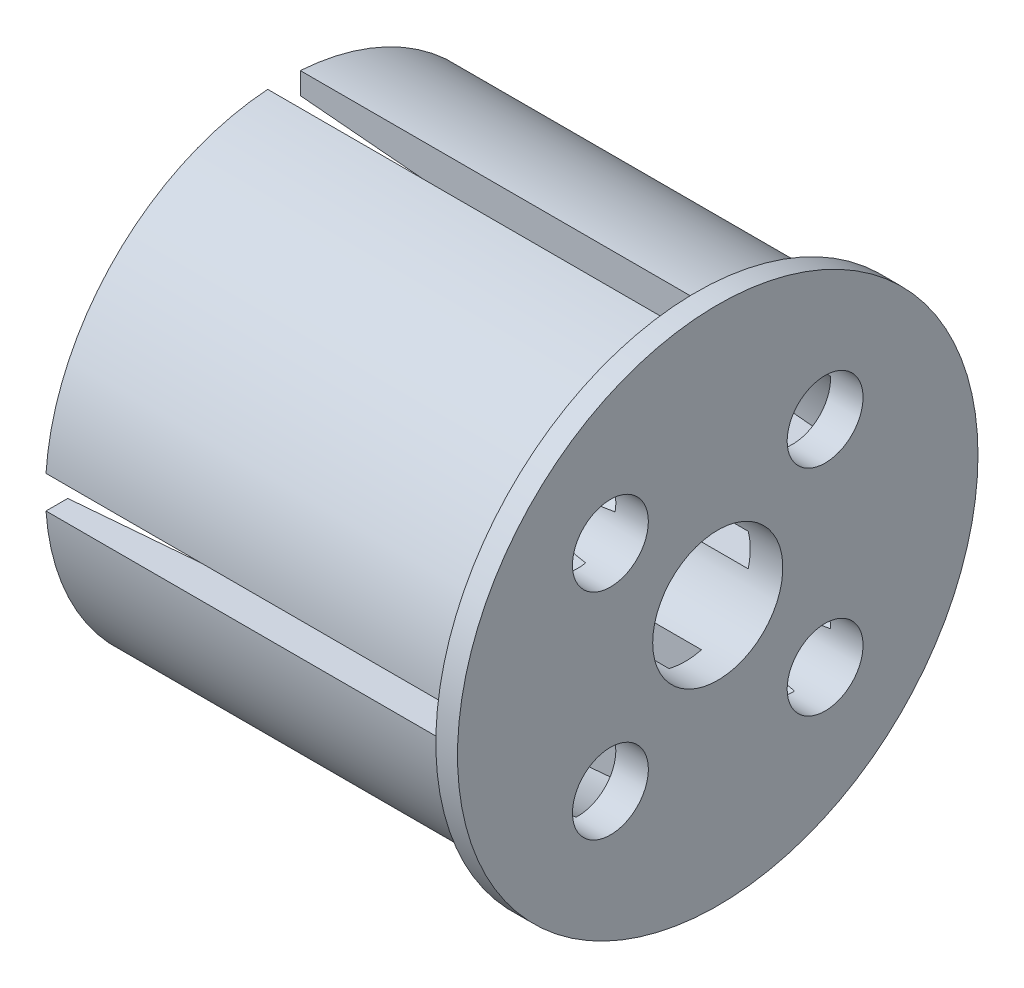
ISO-10303-21;
HEADER;
FILE_DESCRIPTION(('STEP AP214'),'2;1');
FILE_NAME('part.step','',(''),(''),'','','');
FILE_SCHEMA(('AUTOMOTIVE_DESIGN { 1 0 10303 214 1 1 1 1 }'));
ENDSEC;
DATA;
#1=APPLICATION_CONTEXT('core data for automotive mechanical design processes');
#2=APPLICATION_PROTOCOL_DEFINITION('international standard','automotive_design',2000,#1);
#3=PRODUCT_CONTEXT('',#1,'mechanical');
#4=PRODUCT('Part','Part','',(#3));
#5=PRODUCT_RELATED_PRODUCT_CATEGORY('part','',(#4));
#6=PRODUCT_DEFINITION_FORMATION('','',#4);
#7=PRODUCT_DEFINITION_CONTEXT('part definition',#1,'design');
#8=PRODUCT_DEFINITION('design','',#6,#7);
#9=PRODUCT_DEFINITION_SHAPE('','',#8);
#10=(LENGTH_UNIT() NAMED_UNIT(*) SI_UNIT(.MILLI.,.METRE.));
#11=(NAMED_UNIT(*) PLANE_ANGLE_UNIT() SI_UNIT($,.RADIAN.));
#12=(NAMED_UNIT(*) SI_UNIT($,.STERADIAN.) SOLID_ANGLE_UNIT());
#13=UNCERTAINTY_MEASURE_WITH_UNIT(LENGTH_MEASURE(1.E-05),#10,'distance_accuracy_value','');
#14=(GEOMETRIC_REPRESENTATION_CONTEXT(3) GLOBAL_UNCERTAINTY_ASSIGNED_CONTEXT((#13)) GLOBAL_UNIT_ASSIGNED_CONTEXT((#10,
#11,#12)) REPRESENTATION_CONTEXT('',''));
#15=CARTESIAN_POINT('',(0.,0.,0.));
#16=DIRECTION('',(0.,0.,1.));
#17=DIRECTION('',(1.,0.,0.));
#18=AXIS2_PLACEMENT_3D('',#15,#16,#17);
#19=CARTESIAN_POINT('',(0.,0.,0.));
#20=DIRECTION('',(-1.,0.,0.));
#21=DIRECTION('',(0.,0.,1.));
#22=AXIS2_PLACEMENT_3D('',#19,#20,#21);
#23=CYLINDRICAL_SURFACE('',#22,11.);
#24=CARTESIAN_POINT('',(0.,0.,0.));
#25=DIRECTION('',(-1.,0.,0.));
#26=DIRECTION('',(0.,0.,1.));
#27=AXIS2_PLACEMENT_3D('',#24,#25,#26);
#28=CIRCLE('',#27,11.);
#29=CARTESIAN_POINT('',(0.,10.974402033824,-0.75));
#30=VERTEX_POINT('',#29);
#31=CARTESIAN_POINT('',(0.,0.75,-10.974402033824));
#32=VERTEX_POINT('',#31);
#33=EDGE_CURVE('E844',#30,#32,#28,.T.);
#34=ORIENTED_EDGE('',*,*,#33,.F.);
#35=DIRECTION('',(-1.,0.,0.));
#36=VECTOR('',#35,1.);
#37=CARTESIAN_POINT('',(28.8591746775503,10.974402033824,-0.75));
#38=LINE('',#37,#36);
#39=CARTESIAN_POINT('',(18.5,10.974402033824,-0.75));
#40=VERTEX_POINT('',#39);
#41=EDGE_CURVE('E572',#40,#30,#38,.T.);
#42=ORIENTED_EDGE('',*,*,#41,.F.);
#43=CARTESIAN_POINT('',(18.5,0.,0.));
#44=DIRECTION('',(1.,0.,0.));
#45=DIRECTION('',(0.,0.,-1.));
#46=AXIS2_PLACEMENT_3D('',#43,#44,#45);
#47=CIRCLE('',#46,11.);
#48=CARTESIAN_POINT('',(18.5,10.974402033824,0.75));
#49=VERTEX_POINT('',#48);
#50=EDGE_CURVE('E557',#49,#40,#47,.F.);
#51=ORIENTED_EDGE('',*,*,#50,.F.);
#52=DIRECTION('',(-1.,0.,0.));
#53=VECTOR('',#52,1.);
#54=CARTESIAN_POINT('',(28.8591746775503,10.974402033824,0.75));
#55=LINE('',#54,#53);
#56=CARTESIAN_POINT('',(0.,10.974402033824,0.75));
#57=VERTEX_POINT('',#56);
#58=EDGE_CURVE('E568',#49,#57,#55,.T.);
#59=ORIENTED_EDGE('',*,*,#58,.T.);
#60=CARTESIAN_POINT('',(0.,0.75,10.974402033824));
#61=VERTEX_POINT('',#60);
#62=EDGE_CURVE('E849',#61,#57,#28,.T.);
#63=ORIENTED_EDGE('',*,*,#62,.F.);
#64=DIRECTION('',(-1.,0.,0.));
#65=VECTOR('',#64,1.);
#66=CARTESIAN_POINT('',(28.8591746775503,0.75,10.974402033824));
#67=LINE('',#66,#65);
#68=CARTESIAN_POINT('',(18.5,0.75,10.974402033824));
#69=VERTEX_POINT('',#68);
#70=EDGE_CURVE('E705',#69,#61,#67,.T.);
#71=ORIENTED_EDGE('',*,*,#70,.F.);
#72=CARTESIAN_POINT('',(18.5,0.,0.));
#73=DIRECTION('',(1.,0.,0.));
#74=DIRECTION('',(0.,0.,-1.));
#75=AXIS2_PLACEMENT_3D('',#72,#73,#74);
#76=CIRCLE('',#75,11.);
#77=CARTESIAN_POINT('',(18.5,-0.75,10.974402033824));
#78=VERTEX_POINT('',#77);
#79=EDGE_CURVE('E696',#78,#69,#76,.F.);
#80=ORIENTED_EDGE('',*,*,#79,.F.);
#81=DIRECTION('',(-1.,0.,0.));
#82=VECTOR('',#81,1.);
#83=CARTESIAN_POINT('',(28.8591746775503,-0.75,10.974402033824));
#84=LINE('',#83,#82);
#85=CARTESIAN_POINT('',(0.,-0.75,10.974402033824));
#86=VERTEX_POINT('',#85);
#87=EDGE_CURVE('E714',#78,#86,#84,.T.);
#88=ORIENTED_EDGE('',*,*,#87,.T.);
#89=CARTESIAN_POINT('',(0.,-10.974402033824,0.75));
#90=VERTEX_POINT('',#89);
#91=EDGE_CURVE('E839',#90,#86,#28,.T.);
#92=ORIENTED_EDGE('',*,*,#91,.F.);
#93=DIRECTION('',(-1.,0.,0.));
#94=VECTOR('',#93,1.);
#95=CARTESIAN_POINT('',(28.8591746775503,-10.974402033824,0.75));
#96=LINE('',#95,#94);
#97=CARTESIAN_POINT('',(18.5,-10.974402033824,0.75));
#98=VERTEX_POINT('',#97);
#99=EDGE_CURVE('E1283',#98,#90,#96,.T.);
#100=ORIENTED_EDGE('',*,*,#99,.F.);
#101=CARTESIAN_POINT('',(18.5,0.,0.));
#102=DIRECTION('',(1.,0.,0.));
#103=DIRECTION('',(0.,0.,-1.));
#104=AXIS2_PLACEMENT_3D('',#101,#102,#103);
#105=CIRCLE('',#104,11.);
#106=CARTESIAN_POINT('',(18.5,-10.974402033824,-0.75));
#107=VERTEX_POINT('',#106);
#108=EDGE_CURVE('E1287',#107,#98,#105,.F.);
#109=ORIENTED_EDGE('',*,*,#108,.F.);
#110=DIRECTION('',(-1.,0.,0.));
#111=VECTOR('',#110,1.);
#112=CARTESIAN_POINT('',(28.8591746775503,-10.974402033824,-0.75));
#113=LINE('',#112,#111);
#114=CARTESIAN_POINT('',(0.,-10.974402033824,-0.75));
#115=VERTEX_POINT('',#114);
#116=EDGE_CURVE('E1290',#107,#115,#113,.T.);
#117=ORIENTED_EDGE('',*,*,#116,.T.);
#118=CARTESIAN_POINT('',(0.,-0.75,-10.974402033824));
#119=VERTEX_POINT('',#118);
#120=EDGE_CURVE('E843',#119,#115,#28,.T.);
#121=ORIENTED_EDGE('',*,*,#120,.F.);
#122=DIRECTION('',(-1.,0.,0.));
#123=VECTOR('',#122,1.);
#124=CARTESIAN_POINT('',(28.8591746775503,-0.75,-10.974402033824));
#125=LINE('',#124,#123);
#126=CARTESIAN_POINT('',(18.5,-0.75,-10.974402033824));
#127=VERTEX_POINT('',#126);
#128=EDGE_CURVE('E669',#127,#119,#125,.T.);
#129=ORIENTED_EDGE('',*,*,#128,.F.);
#130=CARTESIAN_POINT('',(18.5,0.,0.));
#131=DIRECTION('',(1.,0.,0.));
#132=DIRECTION('',(0.,0.,-1.));
#133=AXIS2_PLACEMENT_3D('',#130,#131,#132);
#134=CIRCLE('',#133,11.);
#135=CARTESIAN_POINT('',(18.5,0.75,-10.974402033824));
#136=VERTEX_POINT('',#135);
#137=EDGE_CURVE('E683',#136,#127,#134,.F.);
#138=ORIENTED_EDGE('',*,*,#137,.F.);
#139=DIRECTION('',(-1.,0.,0.));
#140=VECTOR('',#139,1.);
#141=CARTESIAN_POINT('',(28.8591746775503,0.75,-10.974402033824));
#142=LINE('',#141,#140);
#143=EDGE_CURVE('E687',#136,#32,#142,.T.);
#144=ORIENTED_EDGE('',*,*,#143,.T.);
#145=EDGE_LOOP('',(#34,#42,#51,#59,#63,#71,#80,#88,#92,#100,#109,#117,#121,#129,#138,#144));
#146=FACE_BOUND('',#145,.T.);
#147=CARTESIAN_POINT('',(19.,0.,0.));
#148=DIRECTION('',(1.,0.,0.));
#149=DIRECTION('',(0.,0.,-1.));
#150=AXIS2_PLACEMENT_3D('',#147,#148,#149);
#151=CIRCLE('',#150,11.);
#152=CARTESIAN_POINT('',(19.,0.,-11.));
#153=VERTEX_POINT('',#152);
#154=EDGE_CURVE('E11',#153,#153,#151,.T.);
#155=ORIENTED_EDGE('',*,*,#154,.F.);
#156=EDGE_LOOP('',(#155));
#157=FACE_BOUND('',#156,.T.);
#158=ADVANCED_FACE('F41',(#146,#157),#23,.T.);
#159=CARTESIAN_POINT('',(18.5,0.,0.));
#160=DIRECTION('',(1.,0.,0.));
#161=DIRECTION('',(0.,0.,-1.));
#162=AXIS2_PLACEMENT_3D('',#159,#160,#161);
#163=PLANE('',#162);
#164=CARTESIAN_POINT('',(18.5,0.,0.));
#165=DIRECTION('',(-1.,0.,0.));
#166=DIRECTION('',(0.,0.,1.));
#167=AXIS2_PLACEMENT_3D('',#164,#165,#166);
#168=CIRCLE('',#167,5.61854027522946);
#169=CARTESIAN_POINT('',(18.5,-3.2365638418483,4.59267343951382));
#170=VERTEX_POINT('',#169);
#171=CARTESIAN_POINT('',(18.5,-0.75,5.56825779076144));
#172=VERTEX_POINT('',#171);
#173=EDGE_CURVE('E338',#170,#172,#168,.T.);
#174=ORIENTED_EDGE('',*,*,#173,.F.);
#175=CARTESIAN_POINT('',(18.5,-4.94974746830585,4.94974746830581));
#176=DIRECTION('',(1.,0.,0.));
#177=DIRECTION('',(0.,0.,-1.));
#178=AXIS2_PLACEMENT_3D('',#175,#176,#177);
#179=CIRCLE('',#178,1.75);
#180=CARTESIAN_POINT('',(18.5,-5.03913221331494,6.69746322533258));
#181=VERTEX_POINT('',#180);
#182=EDGE_CURVE('E51',#170,#181,#179,.T.);
#183=ORIENTED_EDGE('',*,*,#182,.T.);
#184=CARTESIAN_POINT('',(18.5,0.,0.));
#185=DIRECTION('',(-1.,0.,0.));
#186=DIRECTION('',(0.,0.,1.));
#187=AXIS2_PLACEMENT_3D('',#184,#185,#186);
#188=CIRCLE('',#187,8.38145972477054);
#189=CARTESIAN_POINT('',(18.5,-0.75,8.34783607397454));
#190=VERTEX_POINT('',#189);
#191=EDGE_CURVE('E341',#181,#190,#188,.T.);
#192=ORIENTED_EDGE('',*,*,#191,.T.);
#193=DIRECTION('',(0.,0.,-1.));
#194=VECTOR('',#193,1.);
#195=CARTESIAN_POINT('',(18.5,-0.75,0.));
#196=LINE('',#195,#194);
#197=EDGE_CURVE('E706',#78,#190,#196,.T.);
#198=ORIENTED_EDGE('',*,*,#197,.F.);
#199=ORIENTED_EDGE('',*,*,#79,.T.);
#200=DIRECTION('',(0.,0.,-1.));
#201=VECTOR('',#200,1.);
#202=CARTESIAN_POINT('',(18.5,0.75,0.));
#203=LINE('',#202,#201);
#204=CARTESIAN_POINT('',(18.5,0.75,8.34783607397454));
#205=VERTEX_POINT('',#204);
#206=EDGE_CURVE('E710',#69,#205,#203,.T.);
#207=ORIENTED_EDGE('',*,*,#206,.T.);
#208=CARTESIAN_POINT('',(18.5,5.03913221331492,6.6974632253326));
#209=VERTEX_POINT('',#208);
#210=EDGE_CURVE('E350',#205,#209,#188,.T.);
#211=ORIENTED_EDGE('',*,*,#210,.T.);
#212=CARTESIAN_POINT('',(18.5,4.94974746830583,4.94974746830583));
#213=DIRECTION('',(1.,0.,0.));
#214=DIRECTION('',(0.,0.,-1.));
#215=AXIS2_PLACEMENT_3D('',#212,#213,#214);
#216=CIRCLE('',#215,1.75);
#217=CARTESIAN_POINT('',(18.5,3.23656384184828,4.59267343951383));
#218=VERTEX_POINT('',#217);
#219=EDGE_CURVE('E307',#209,#218,#216,.T.);
#220=ORIENTED_EDGE('',*,*,#219,.T.);
#221=CARTESIAN_POINT('',(18.5,0.75,5.56825779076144));
#222=VERTEX_POINT('',#221);
#223=EDGE_CURVE('E329',#222,#218,#168,.T.);
#224=ORIENTED_EDGE('',*,*,#223,.F.);
#225=CARTESIAN_POINT('',(18.5,0.75,2.90473750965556));
#226=VERTEX_POINT('',#225);
#227=EDGE_CURVE('E715',#222,#226,#203,.T.);
#228=ORIENTED_EDGE('',*,*,#227,.T.);
#229=CARTESIAN_POINT('',(18.5,0.,0.));
#230=DIRECTION('',(1.,0.,0.));
#231=DIRECTION('',(0.,0.,-1.));
#232=AXIS2_PLACEMENT_3D('',#229,#230,#231);
#233=CIRCLE('',#232,3.);
#234=CARTESIAN_POINT('',(18.5,-0.75,2.90473750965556));
#235=VERTEX_POINT('',#234);
#236=EDGE_CURVE('E365',#235,#226,#233,.F.);
#237=ORIENTED_EDGE('',*,*,#236,.F.);
#238=EDGE_CURVE('E657',#172,#235,#196,.T.);
#239=ORIENTED_EDGE('',*,*,#238,.F.);
#240=EDGE_LOOP('',(#174,#183,#192,#198,#199,#207,#211,#220,#224,#228,#237,#239));
#241=FACE_BOUND('',#240,.T.);
#242=ADVANCED_FACE('F905',(#241),#163,.F.);
#243=CARTESIAN_POINT('',(18.5,-8.34783607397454,0.75));
#244=VERTEX_POINT('',#243);
#245=CARTESIAN_POINT('',(18.5,-6.69746322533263,5.03913221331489));
#246=VERTEX_POINT('',#245);
#247=EDGE_CURVE('E348',#244,#246,#188,.T.);
#248=ORIENTED_EDGE('',*,*,#247,.T.);
#249=CARTESIAN_POINT('',(18.5,-4.59267343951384,3.23656384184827));
#250=VERTEX_POINT('',#249);
#251=EDGE_CURVE('E792',#246,#250,#179,.T.);
#252=ORIENTED_EDGE('',*,*,#251,.T.);
#253=CARTESIAN_POINT('',(18.5,-5.56825779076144,0.75));
#254=VERTEX_POINT('',#253);
#255=EDGE_CURVE('E333',#254,#250,#168,.T.);
#256=ORIENTED_EDGE('',*,*,#255,.F.);
#257=DIRECTION('',(0.,-1.,0.));
#258=VECTOR('',#257,1.);
#259=CARTESIAN_POINT('',(18.5,0.,0.75));
#260=LINE('',#259,#258);
#261=CARTESIAN_POINT('',(18.5,-2.90473750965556,0.75));
#262=VERTEX_POINT('',#261);
#263=EDGE_CURVE('E1273',#262,#254,#260,.T.);
#264=ORIENTED_EDGE('',*,*,#263,.F.);
#265=CARTESIAN_POINT('',(18.5,0.,0.));
#266=DIRECTION('',(1.,0.,0.));
#267=DIRECTION('',(0.,0.,-1.));
#268=AXIS2_PLACEMENT_3D('',#265,#266,#267);
#269=CIRCLE('',#268,3.);
#270=CARTESIAN_POINT('',(18.5,-2.90473750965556,-0.75));
#271=VERTEX_POINT('',#270);
#272=EDGE_CURVE('E651',#271,#262,#269,.F.);
#273=ORIENTED_EDGE('',*,*,#272,.F.);
#274=DIRECTION('',(0.,-1.,0.));
#275=VECTOR('',#274,1.);
#276=CARTESIAN_POINT('',(18.5,0.,-0.75));
#277=LINE('',#276,#275);
#278=CARTESIAN_POINT('',(18.5,-5.56825779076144,-0.75));
#279=VERTEX_POINT('',#278);
#280=EDGE_CURVE('E1293',#271,#279,#277,.T.);
#281=ORIENTED_EDGE('',*,*,#280,.T.);
#282=CARTESIAN_POINT('',(18.5,-4.59267343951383,-3.23656384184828));
#283=VERTEX_POINT('',#282);
#284=EDGE_CURVE('E328',#283,#279,#168,.T.);
#285=ORIENTED_EDGE('',*,*,#284,.F.);
#286=CARTESIAN_POINT('',(18.5,-4.94974746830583,-4.94974746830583));
#287=DIRECTION('',(1.,0.,0.));
#288=DIRECTION('',(0.,0.,-1.));
#289=AXIS2_PLACEMENT_3D('',#286,#287,#288);
#290=CIRCLE('',#289,1.75);
#291=CARTESIAN_POINT('',(18.5,-6.6974632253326,-5.03913221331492));
#292=VERTEX_POINT('',#291);
#293=EDGE_CURVE('E791',#283,#292,#290,.T.);
#294=ORIENTED_EDGE('',*,*,#293,.T.);
#295=CARTESIAN_POINT('',(18.5,-8.34783607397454,-0.75));
#296=VERTEX_POINT('',#295);
#297=EDGE_CURVE('E349',#292,#296,#188,.T.);
#298=ORIENTED_EDGE('',*,*,#297,.T.);
#299=EDGE_CURVE('E1276',#296,#107,#277,.T.);
#300=ORIENTED_EDGE('',*,*,#299,.T.);
#301=ORIENTED_EDGE('',*,*,#108,.T.);
#302=EDGE_CURVE('E1277',#244,#98,#260,.T.);
#303=ORIENTED_EDGE('',*,*,#302,.F.);
#304=EDGE_LOOP('',(#248,#252,#256,#264,#273,#281,#285,#294,#298,#300,#301,#303));
#305=FACE_BOUND('',#304,.T.);
#306=ADVANCED_FACE('F803',(#305),#163,.F.);
#307=CARTESIAN_POINT('',(18.5,8.34783607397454,-0.75));
#308=VERTEX_POINT('',#307);
#309=CARTESIAN_POINT('',(18.5,6.69746322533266,-5.03913221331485));
#310=VERTEX_POINT('',#309);
#311=EDGE_CURVE('E812',#308,#310,#188,.T.);
#312=ORIENTED_EDGE('',*,*,#311,.T.);
#313=CARTESIAN_POINT('',(18.5,4.94974746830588,-4.94974746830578));
#314=DIRECTION('',(1.,0.,0.));
#315=DIRECTION('',(0.,0.,-1.));
#316=AXIS2_PLACEMENT_3D('',#313,#314,#315);
#317=CIRCLE('',#316,1.75);
#318=CARTESIAN_POINT('',(18.5,4.59267343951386,-3.23656384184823));
#319=VERTEX_POINT('',#318);
#320=EDGE_CURVE('E306',#310,#319,#317,.T.);
#321=ORIENTED_EDGE('',*,*,#320,.T.);
#322=CARTESIAN_POINT('',(18.5,5.56825779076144,-0.75));
#323=VERTEX_POINT('',#322);
#324=EDGE_CURVE('E316',#323,#319,#168,.T.);
#325=ORIENTED_EDGE('',*,*,#324,.F.);
#326=DIRECTION('',(0.,-1.,0.));
#327=VECTOR('',#326,1.);
#328=CARTESIAN_POINT('',(18.5,0.,-0.75));
#329=LINE('',#328,#327);
#330=CARTESIAN_POINT('',(18.5,2.90473750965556,-0.75));
#331=VERTEX_POINT('',#330);
#332=EDGE_CURVE('E562',#323,#331,#329,.T.);
#333=ORIENTED_EDGE('',*,*,#332,.T.);
#334=CARTESIAN_POINT('',(18.5,0.,0.));
#335=DIRECTION('',(1.,0.,0.));
#336=DIRECTION('',(0.,0.,-1.));
#337=AXIS2_PLACEMENT_3D('',#334,#335,#336);
#338=CIRCLE('',#337,3.);
#339=CARTESIAN_POINT('',(18.5,2.90473750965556,0.75));
#340=VERTEX_POINT('',#339);
#341=EDGE_CURVE('E609',#340,#331,#338,.F.);
#342=ORIENTED_EDGE('',*,*,#341,.F.);
#343=DIRECTION('',(0.,-1.,0.));
#344=VECTOR('',#343,1.);
#345=CARTESIAN_POINT('',(18.5,0.,0.75));
#346=LINE('',#345,#344);
#347=CARTESIAN_POINT('',(18.5,5.56825779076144,0.75));
#348=VERTEX_POINT('',#347);
#349=EDGE_CURVE('E552',#348,#340,#346,.T.);
#350=ORIENTED_EDGE('',*,*,#349,.F.);
#351=CARTESIAN_POINT('',(18.5,4.59267343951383,3.23656384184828));
#352=VERTEX_POINT('',#351);
#353=EDGE_CURVE('E332',#352,#348,#168,.T.);
#354=ORIENTED_EDGE('',*,*,#353,.F.);
#355=CARTESIAN_POINT('',(18.5,6.69746322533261,5.03913221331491));
#356=VERTEX_POINT('',#355);
#357=EDGE_CURVE('E778',#352,#356,#216,.T.);
#358=ORIENTED_EDGE('',*,*,#357,.T.);
#359=CARTESIAN_POINT('',(18.5,8.34783607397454,0.75));
#360=VERTEX_POINT('',#359);
#361=EDGE_CURVE('E815',#356,#360,#188,.T.);
#362=ORIENTED_EDGE('',*,*,#361,.T.);
#363=EDGE_CURVE('E573',#49,#360,#346,.T.);
#364=ORIENTED_EDGE('',*,*,#363,.F.);
#365=ORIENTED_EDGE('',*,*,#50,.T.);
#366=EDGE_CURVE('E564',#40,#308,#329,.T.);
#367=ORIENTED_EDGE('',*,*,#366,.T.);
#368=EDGE_LOOP('',(#312,#321,#325,#333,#342,#350,#354,#358,#362,#364,#365,#367));
#369=FACE_BOUND('',#368,.T.);
#370=ADVANCED_FACE('F950',(#369),#163,.F.);
#371=CARTESIAN_POINT('',(18.5,0.,0.));
#372=DIRECTION('',(1.,0.,0.));
#373=DIRECTION('',(0.,0.,-1.));
#374=AXIS2_PLACEMENT_3D('',#371,#372,#373);
#375=CONICAL_SURFACE('',#374,5.61854027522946,0.0872664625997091);
#376=ORIENTED_EDGE('',*,*,#223,.T.);
#377=CARTESIAN_POINT('',(18.5002,3.23655861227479,4.59269853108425));
#378=CARTESIAN_POINT('',(18.3577431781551,3.24028918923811,4.57482053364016));
#379=CARTESIAN_POINT('',(18.2153306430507,3.24436381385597,4.55664998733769));
#380=CARTESIAN_POINT('',(17.9306051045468,3.25332807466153,4.51959770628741));
#381=CARTESIAN_POINT('',(17.7882921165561,3.25821781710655,4.50071587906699));
#382=CARTESIAN_POINT('',(17.5032123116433,3.26896098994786,4.46203793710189));
#383=CARTESIAN_POINT('',(17.3604461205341,3.27481840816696,4.44223829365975));
#384=CARTESIAN_POINT('',(17.0751221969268,3.28766729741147,4.40161968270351));
#385=CARTESIAN_POINT('',(16.9325644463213,3.29465866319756,4.38080080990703));
#386=CARTESIAN_POINT('',(16.6435594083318,3.31026303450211,4.33725956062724));
#387=CARTESIAN_POINT('',(16.4971200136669,3.31891740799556,4.31449936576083));
#388=CARTESIAN_POINT('',(16.2046059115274,3.33813685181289,4.26720254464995));
#389=CARTESIAN_POINT('',(16.0585313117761,3.34870243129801,4.24266544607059));
#390=CARTESIAN_POINT('',(15.7673066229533,3.37246273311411,4.19114880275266));
#391=CARTESIAN_POINT('',(15.6221553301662,3.38565260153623,4.16417381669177));
#392=CARTESIAN_POINT('',(15.3330130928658,3.41593366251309,4.10652960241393));
#393=CARTESIAN_POINT('',(15.1890215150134,3.43302255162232,4.07586256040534));
#394=CARTESIAN_POINT('',(14.976045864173,3.46397291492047,4.02489900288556));
#395=CARTESIAN_POINT('',(14.9060411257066,3.47507895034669,4.00722617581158));
#396=CARTESIAN_POINT('',(14.7671550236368,3.50001035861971,3.96928885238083));
#397=CARTESIAN_POINT('',(14.6982737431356,3.51383593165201,3.94902416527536));
#398=CARTESIAN_POINT('',(14.5968932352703,3.5382919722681,3.91510662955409));
#399=CARTESIAN_POINT('',(14.5633853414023,3.54707602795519,3.90319807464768));
#400=CARTESIAN_POINT('',(14.4976278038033,3.56651481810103,3.87763256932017));
#401=CARTESIAN_POINT('',(14.4653766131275,3.57716715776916,3.86397786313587));
#402=CARTESIAN_POINT('',(14.4093783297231,3.5992489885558,3.83668693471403));
#403=CARTESIAN_POINT('',(14.3851981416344,3.61012327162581,3.82356483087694));
#404=CARTESIAN_POINT('',(14.3517726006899,3.62918035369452,3.80140209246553));
#405=CARTESIAN_POINT('',(14.3410354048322,3.6360524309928,3.79353269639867));
#406=CARTESIAN_POINT('',(14.3214221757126,3.65103759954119,3.77672618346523));
#407=CARTESIAN_POINT('',(14.3125352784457,3.65914293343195,3.76779581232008));
#408=CARTESIAN_POINT('',(14.3018283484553,3.67226571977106,3.75367917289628));
#409=CARTESIAN_POINT('',(14.298730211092,3.67671290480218,3.74894443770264));
#410=CARTESIAN_POINT('',(14.2935567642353,3.68593728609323,3.73923991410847));
#411=CARTESIAN_POINT('',(14.291480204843,3.69071407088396,3.734270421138));
#412=CARTESIAN_POINT('',(14.2885591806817,3.7005599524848,3.72415346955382));
#413=CARTESIAN_POINT('',(14.2877262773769,3.70563134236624,3.71900479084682));
#414=CARTESIAN_POINT('',(14.2874472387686,3.71585815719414,3.70875208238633));
#415=CARTESIAN_POINT('',(14.2880009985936,3.72101357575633,3.70364804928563));
#416=CARTESIAN_POINT('',(14.2902959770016,3.73072404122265,3.69415055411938));
#417=CARTESIAN_POINT('',(14.2919162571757,3.73528864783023,3.6897363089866));
#418=CARTESIAN_POINT('',(14.2960605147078,3.74424241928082,3.68116714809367));
#419=CARTESIAN_POINT('',(14.2985849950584,3.74863148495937,3.67701237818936));
#420=CARTESIAN_POINT('',(14.3063234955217,3.76011065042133,3.66625147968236));
#421=CARTESIAN_POINT('',(14.3121970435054,3.76699903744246,3.65990831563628));
#422=CARTESIAN_POINT('',(14.3252687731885,3.78014404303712,3.64797693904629));
#423=CARTESIAN_POINT('',(14.3324715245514,3.78639836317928,3.64239144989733));
#424=CARTESIAN_POINT('',(14.3596825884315,3.80779576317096,3.62352134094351));
#425=CARTESIAN_POINT('',(14.3820053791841,3.82143829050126,3.61195303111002));
#426=CARTESIAN_POINT('',(14.4287946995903,3.84662887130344,3.59111279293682));
#427=CARTESIAN_POINT('',(14.4532748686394,3.85816193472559,3.58185714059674));
#428=CARTESIAN_POINT('',(14.5269945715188,3.89014538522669,3.55673633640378));
#429=CARTESIAN_POINT('',(14.57773874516,3.90870443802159,3.54290669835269));
#430=CARTESIAN_POINT('',(14.6808154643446,3.94317704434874,3.51805357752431));
#431=CARTESIAN_POINT('',(14.7331522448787,3.95908265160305,3.50703847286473));
#432=CARTESIAN_POINT('',(14.8387719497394,3.98917485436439,3.48682873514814));
#433=CARTESIAN_POINT('',(14.8920563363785,4.00335846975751,3.47763724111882));
#434=CARTESIAN_POINT('',(14.9990479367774,4.03048004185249,3.46055289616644));
#435=CARTESIAN_POINT('',(15.052754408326,4.0434198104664,3.45265814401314));
#436=CARTESIAN_POINT('',(15.2132297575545,4.08062024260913,3.43055241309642));
#437=CARTESIAN_POINT('',(15.3204919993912,4.1035673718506,3.4177210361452));
#438=CARTESIAN_POINT('',(15.535731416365,4.14722601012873,3.39441529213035));
#439=CARTESIAN_POINT('',(15.6437087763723,4.16793691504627,3.38394156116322));
#440=CARTESIAN_POINT('',(15.968552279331,4.22776091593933,3.35499728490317));
#441=CARTESIAN_POINT('',(16.1860740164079,4.26451030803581,3.33903458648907));
#442=CARTESIAN_POINT('',(16.6215238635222,4.33423153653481,3.31114634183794));
#443=CARTESIAN_POINT('',(16.8394504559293,4.36721029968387,3.29921331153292));
#444=CARTESIAN_POINT('',(17.2757007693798,4.43057643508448,3.27819808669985));
#445=CARTESIAN_POINT('',(17.4940242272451,4.46096513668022,3.26911442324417));
#446=CARTESIAN_POINT('',(17.8436987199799,4.50807903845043,3.2563008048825));
#447=CARTESIAN_POINT('',(17.9749447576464,4.5254120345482,3.25188192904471));
#448=CARTESIAN_POINT('',(18.2375140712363,4.55948023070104,3.24372956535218));
#449=CARTESIAN_POINT('',(18.368837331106,4.57621552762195,3.23999596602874));
#450=CARTESIAN_POINT('',(18.5002,4.59269853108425,3.23655861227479));
#451=B_SPLINE_CURVE_WITH_KNOTS('',3,(#377,#378,#379,#380,#381,#382,#383,#384,#385,#386,#387,
#388,#389,#390,#391,#392,#393,#394,#395,#396,#397,#398,#399,#400,#401,#402,#403,#404,#405,#406,
#407,#408,#409,#410,#411,#412,#413,#414,#415,#416,#417,#418,#419,#420,#421,#422,#423,#424,#425,
#426,#427,#428,#429,#430,#431,#432,#433,#434,#435,#436,#437,#438,#439,#440,#441,#442,#443,#444,
#445,#446,#447,#448,#449,#450),.UNSPECIFIED.,.F.,.F.,(4,2,2,2,2,2,2,2,2,2,2,2,2,2,2,2,2,2,2,2,2,
2,2,2,2,2,2,2,2,2,2,2,2,2,2,2,4),(0.,0.430869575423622,0.861795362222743,1.29454345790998,
1.72725141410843,2.17258631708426,2.61804003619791,3.06267737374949,3.50705270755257,
3.72615949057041,3.9452824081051,4.05510044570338,4.16477873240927,4.25310072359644,
4.29793898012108,4.3425060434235,4.36402995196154,4.38552746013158,4.40722359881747,
4.42891809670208,4.44849910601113,4.46809102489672,4.501058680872,4.5341418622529,
4.61928734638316,4.70501618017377,4.8718843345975,5.03924357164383,5.20688843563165,
5.37428526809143,5.7055001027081,6.03680419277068,6.70020210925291,7.36236107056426,
8.024178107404,8.42155383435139,8.81886486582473),.UNSPECIFIED.);
#452=EDGE_CURVE('E545',#218,#352,#451,.T.);
#453=ORIENTED_EDGE('',*,*,#452,.T.);
#454=ORIENTED_EDGE('',*,*,#353,.T.);
#455=CARTESIAN_POINT('',(-19.1300898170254,2.20211941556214,0.75));
#456=CARTESIAN_POINT('',(-18.4198375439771,2.26775741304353,0.75));
#457=CARTESIAN_POINT('',(-17.7095585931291,2.33310577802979,0.75));
#458=CARTESIAN_POINT('',(-16.2889577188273,2.46333076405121,0.75));
#459=CARTESIAN_POINT('',(-15.5786357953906,2.52820738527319,0.75));
#460=CARTESIAN_POINT('',(-13.4476198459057,2.72229103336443,0.75));
#461=CARTESIAN_POINT('',(-12.0268760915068,2.85095180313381,0.75));
#462=CARTESIAN_POINT('',(-9.18530164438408,3.10731014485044,0.75));
#463=CARTESIAN_POINT('',(-7.76447095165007,3.23500771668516,0.75));
#464=CARTESIAN_POINT('',(-3.50188731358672,3.61711006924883,0.75));
#465=CARTESIAN_POINT('',(-0.660045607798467,3.87052423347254,0.75));
#466=CARTESIAN_POINT('',(5.1357236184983,4.38589534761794,0.75));
#467=CARTESIAN_POINT('',(8.08965617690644,4.64779553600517,0.75));
#468=CARTESIAN_POINT('',(13.9976033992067,5.17067014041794,0.75));
#469=CARTESIAN_POINT('',(16.9516180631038,5.4316445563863,0.75));
#470=CARTESIAN_POINT('',(22.8596888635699,5.95300135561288,0.75));
#471=CARTESIAN_POINT('',(25.8137449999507,6.21338374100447,0.75));
#472=CARTESIAN_POINT('',(31.7218937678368,6.73373008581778,0.75));
#473=CARTESIAN_POINT('',(34.6759863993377,6.99369404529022,0.75));
#474=CARTESIAN_POINT('',(37.6300898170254,7.2535351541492,0.75));
#475=B_SPLINE_CURVE_WITH_KNOTS('',3,(#455,#456,#457,#458,#459,#460,#461,#462,#463,#464,#465,
#466,#467,#468,#469,#470,#471,#472,#473,#474),.UNSPECIFIED.,.F.,.F.,(4,2,2,2,2,2,2,2,2,4),(0.,
2.13983619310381,4.27967153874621,8.55934358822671,12.8390161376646,21.3983696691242,
30.2949297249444,39.1914903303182,48.0880188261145,56.9845462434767),.UNSPECIFIED.);
#476=CARTESIAN_POINT('',(0.,3.92905841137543,0.75));
#477=VERTEX_POINT('',#476);
#478=EDGE_CURVE('E588',#477,#348,#475,.T.);
#479=ORIENTED_EDGE('',*,*,#478,.F.);
#480=CARTESIAN_POINT('',(0.,0.,0.));
#481=DIRECTION('',(-1.,0.,0.));
#482=DIRECTION('',(0.,0.,1.));
#483=AXIS2_PLACEMENT_3D('',#480,#481,#482);
#484=CIRCLE('',#483,4.);
#485=CARTESIAN_POINT('',(0.,0.75,3.92905841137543));
#486=VERTEX_POINT('',#485);
#487=EDGE_CURVE('E770',#486,#477,#484,.T.);
#488=ORIENTED_EDGE('',*,*,#487,.F.);
#489=CARTESIAN_POINT('',(-19.1300898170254,0.75,2.20211941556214));
#490=CARTESIAN_POINT('',(-18.4198375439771,0.75,2.26775741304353));
#491=CARTESIAN_POINT('',(-17.7095585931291,0.75,2.33310577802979));
#492=CARTESIAN_POINT('',(-16.2889577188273,0.75,2.46333076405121));
#493=CARTESIAN_POINT('',(-15.5786357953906,0.75,2.52820738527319));
#494=CARTESIAN_POINT('',(-13.4476198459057,0.75,2.72229103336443));
#495=CARTESIAN_POINT('',(-12.0268760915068,0.75,2.85095180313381));
#496=CARTESIAN_POINT('',(-9.18530164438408,0.75,3.10731014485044));
#497=CARTESIAN_POINT('',(-7.76447095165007,0.75,3.23500771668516));
#498=CARTESIAN_POINT('',(-3.50188731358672,0.75,3.61711006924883));
#499=CARTESIAN_POINT('',(-0.660045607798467,0.75,3.87052423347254));
#500=CARTESIAN_POINT('',(5.1357236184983,0.75,4.38589534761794));
#501=CARTESIAN_POINT('',(8.08965617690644,0.75,4.64779553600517));
#502=CARTESIAN_POINT('',(13.9976033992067,0.75,5.17067014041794));
#503=CARTESIAN_POINT('',(16.9516180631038,0.75,5.4316445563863));
#504=CARTESIAN_POINT('',(22.8596888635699,0.75,5.95300135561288));
#505=CARTESIAN_POINT('',(25.8137449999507,0.75,6.21338374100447));
#506=CARTESIAN_POINT('',(31.7218937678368,0.75,6.73373008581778));
#507=CARTESIAN_POINT('',(34.6759863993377,0.75,6.99369404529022));
#508=CARTESIAN_POINT('',(37.6300898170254,0.75,7.2535351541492));
#509=B_SPLINE_CURVE_WITH_KNOTS('',3,(#489,#490,#491,#492,#493,#494,#495,#496,#497,#498,#499,
#500,#501,#502,#503,#504,#505,#506,#507,#508),.UNSPECIFIED.,.F.,.F.,(4,2,2,2,2,2,2,2,2,4),(0.,
2.13983619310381,4.27967153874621,8.55934358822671,12.8390161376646,21.3983696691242,
30.2949297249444,39.1914903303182,48.0880188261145,56.9845462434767),.UNSPECIFIED.);
#510=EDGE_CURVE('E879',#486,#222,#509,.T.);
#511=ORIENTED_EDGE('',*,*,#510,.T.);
#512=EDGE_LOOP('',(#376,#453,#454,#479,#488,#511));
#513=FACE_BOUND('',#512,.T.);
#514=ADVANCED_FACE('F927',(#513),#375,.T.);
#515=CARTESIAN_POINT('',(0.,0.,0.));
#516=DIRECTION('',(1.,0.,0.));
#517=DIRECTION('',(0.,0.,-1.));
#518=AXIS2_PLACEMENT_3D('',#515,#516,#517);
#519=PLANE('',#518);
#520=DIRECTION('',(0.,-1.,0.));
#521=VECTOR('',#520,1.);
#522=CARTESIAN_POINT('',(0.,0.,0.75));
#523=LINE('',#522,#521);
#524=CARTESIAN_POINT('',(0.,2.90473750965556,0.75));
#525=VERTEX_POINT('',#524);
#526=EDGE_CURVE('E558',#477,#525,#523,.T.);
#527=ORIENTED_EDGE('',*,*,#526,.T.);
#528=CARTESIAN_POINT('',(0.,0.,0.));
#529=DIRECTION('',(-1.,0.,0.));
#530=DIRECTION('',(0.,0.,1.));
#531=AXIS2_PLACEMENT_3D('',#528,#529,#530);
#532=CIRCLE('',#531,3.);
#533=CARTESIAN_POINT('',(0.,0.75,2.90473750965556));
#534=VERTEX_POINT('',#533);
#535=EDGE_CURVE('E773',#534,#525,#532,.T.);
#536=ORIENTED_EDGE('',*,*,#535,.F.);
#537=DIRECTION('',(0.,0.,-1.));
#538=VECTOR('',#537,1.);
#539=CARTESIAN_POINT('',(0.,0.75,0.));
#540=LINE('',#539,#538);
#541=EDGE_CURVE('E697',#486,#534,#540,.T.);
#542=ORIENTED_EDGE('',*,*,#541,.F.);
#543=ORIENTED_EDGE('',*,*,#487,.T.);
#544=EDGE_LOOP('',(#527,#536,#542,#543));
#545=FACE_BOUND('',#544,.T.);
#546=ADVANCED_FACE('F922',(#545),#519,.F.);
#547=CARTESIAN_POINT('',(0.,0.,0.));
#548=DIRECTION('',(1.,0.,0.));
#549=DIRECTION('',(0.,0.,-1.));
#550=AXIS2_PLACEMENT_3D('',#547,#548,#549);
#551=PLANE('',#550);
#552=CARTESIAN_POINT('',(0.,9.97183533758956,0.75));
#553=VERTEX_POINT('',#552);
#554=EDGE_CURVE('E553',#57,#553,#523,.T.);
#555=ORIENTED_EDGE('',*,*,#554,.T.);
#556=CARTESIAN_POINT('',(0.,0.,0.));
#557=DIRECTION('',(-1.,0.,0.));
#558=DIRECTION('',(0.,0.,1.));
#559=AXIS2_PLACEMENT_3D('',#556,#557,#558);
#560=CIRCLE('',#559,10.);
#561=CARTESIAN_POINT('',(0.,0.75,9.97183533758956));
#562=VERTEX_POINT('',#561);
#563=EDGE_CURVE('E833',#562,#553,#560,.T.);
#564=ORIENTED_EDGE('',*,*,#563,.F.);
#565=EDGE_CURVE('E693',#61,#562,#540,.T.);
#566=ORIENTED_EDGE('',*,*,#565,.F.);
#567=ORIENTED_EDGE('',*,*,#62,.T.);
#568=EDGE_LOOP('',(#555,#564,#566,#567));
#569=FACE_BOUND('',#568,.T.);
#570=ADVANCED_FACE('F929',(#569),#551,.F.);
#571=CARTESIAN_POINT('',(0.,0.,0.));
#572=DIRECTION('',(-1.,0.,0.));
#573=DIRECTION('',(0.,0.,1.));
#574=AXIS2_PLACEMENT_3D('',#571,#572,#573);
#575=CONICAL_SURFACE('',#574,10.,0.087266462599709);
#576=ORIENTED_EDGE('',*,*,#361,.F.);
#577=CARTESIAN_POINT('',(18.5002,6.69746482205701,5.03910098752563));
#578=CARTESIAN_POINT('',(18.3549425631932,6.69629721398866,5.06178775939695));
#579=CARTESIAN_POINT('',(18.2097624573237,6.69467667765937,5.08496499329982));
#580=CARTESIAN_POINT('',(17.9195841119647,6.69034668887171,5.13247894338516));
#581=CARTESIAN_POINT('',(17.7745859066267,6.68763705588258,5.15681585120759));
#582=CARTESIAN_POINT('',(17.4839522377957,6.68092542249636,5.20697468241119));
#583=CARTESIAN_POINT('',(17.3383183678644,6.67691554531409,5.23280484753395));
#584=CARTESIAN_POINT('',(17.0474069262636,6.66733969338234,5.28606595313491));
#585=CARTESIAN_POINT('',(16.9021293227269,6.66177386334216,5.31349674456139));
#586=CARTESIAN_POINT('',(16.6145417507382,6.64882212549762,5.36982840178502));
#587=CARTESIAN_POINT('',(16.4722238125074,6.64146926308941,5.39869575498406));
#588=CARTESIAN_POINT('',(16.1882035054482,6.6243520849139,5.45884223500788));
#589=CARTESIAN_POINT('',(16.0465012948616,6.61458718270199,5.4901219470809));
#590=CARTESIAN_POINT('',(15.764401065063,6.59182156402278,5.55581138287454));
#591=CARTESIAN_POINT('',(15.6240008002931,6.57882831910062,5.5902137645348));
#592=CARTESIAN_POINT('',(15.4147371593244,6.55569251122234,5.64532685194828));
#593=CARTESIAN_POINT('',(15.3452121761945,6.54737391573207,5.66428076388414));
#594=CARTESIAN_POINT('',(15.2068010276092,6.52916084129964,5.7036888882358));
#595=CARTESIAN_POINT('',(15.1379147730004,6.51926658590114,5.72414288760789));
#596=CARTESIAN_POINT('',(15.0086910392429,6.49857787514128,5.76466103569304));
#597=CARTESIAN_POINT('',(14.9482542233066,6.48800562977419,5.78451593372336));
#598=CARTESIAN_POINT('',(14.8286078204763,6.46454213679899,5.82637270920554));
#599=CARTESIAN_POINT('',(14.7693978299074,6.45165166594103,5.84837386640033));
#600=CARTESIAN_POINT('',(14.6519987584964,6.42218813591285,5.89591743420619));
#601=CARTESIAN_POINT('',(14.5938431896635,6.40555722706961,5.92151280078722));
#602=CARTESIAN_POINT('',(14.5105387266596,6.37604642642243,5.96387512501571));
#603=CARTESIAN_POINT('',(14.4835359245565,6.36550511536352,5.97858399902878));
#604=CARTESIAN_POINT('',(14.4316463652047,6.34225372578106,6.00984698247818));
#605=CARTESIAN_POINT('',(14.406752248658,6.32955169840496,6.02639416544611));
#606=CARTESIAN_POINT('',(14.3721273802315,6.30793232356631,6.05336344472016));
#607=CARTESIAN_POINT('',(14.3609296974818,6.30019711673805,6.06282913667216));
#608=CARTESIAN_POINT('',(14.3400754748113,6.28368997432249,6.0825595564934));
#609=CARTESIAN_POINT('',(14.3304180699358,6.27491862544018,6.09282383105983));
#610=CARTESIAN_POINT('',(14.3152458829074,6.2582154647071,6.11187270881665));
#611=CARTESIAN_POINT('',(14.3092868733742,6.25051186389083,6.12049771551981));
#612=CARTESIAN_POINT('',(14.29928818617,6.23437905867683,6.1381766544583));
#613=CARTESIAN_POINT('',(14.2952450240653,6.22595120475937,6.14722977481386));
#614=CARTESIAN_POINT('',(14.2900058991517,6.20988343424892,6.16410778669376));
#615=CARTESIAN_POINT('',(14.2884630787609,6.20232697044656,6.17190286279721));
#616=CARTESIAN_POINT('',(14.2872554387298,6.18699527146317,6.18742133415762));
#617=CARTESIAN_POINT('',(14.2875896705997,6.17922014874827,6.19514476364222));
#618=CARTESIAN_POINT('',(14.2900922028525,6.16370340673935,6.21027447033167));
#619=CARTESIAN_POINT('',(14.2922559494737,6.15596175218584,6.2176814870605));
#620=CARTESIAN_POINT('',(14.2981856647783,6.14068016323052,6.2320460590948));
#621=CARTESIAN_POINT('',(14.301953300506,6.13314044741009,6.23900313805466));
#622=CARTESIAN_POINT('',(14.3132612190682,6.11424530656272,6.2561497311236));
#623=CARTESIAN_POINT('',(14.3217327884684,6.10311614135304,6.2659690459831));
#624=CARTESIAN_POINT('',(14.3408055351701,6.08172883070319,6.28440786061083));
#625=CARTESIAN_POINT('',(14.3514131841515,6.07147347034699,6.29302357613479));
#626=CARTESIAN_POINT('',(14.3849718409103,6.04219330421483,6.31711748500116));
#627=CARTESIAN_POINT('',(14.4099193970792,6.02430569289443,6.33115081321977));
#628=CARTESIAN_POINT('',(14.4624264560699,5.99071735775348,6.35663047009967));
#629=CARTESIAN_POINT('',(14.4899945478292,5.97502427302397,6.36806784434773));
#630=CARTESIAN_POINT('',(14.57099007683,5.93232509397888,6.39826921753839));
#631=CARTESIAN_POINT('',(14.6262191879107,5.9072313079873,6.41484756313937));
#632=CARTESIAN_POINT('',(14.7389477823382,5.86019614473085,6.44451696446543));
#633=CARTESIAN_POINT('',(14.7964531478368,5.8382637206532,6.45759820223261));
#634=CARTESIAN_POINT('',(14.9130230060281,5.79648223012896,6.48145327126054));
#635=CARTESIAN_POINT('',(14.972093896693,5.77664422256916,6.49221513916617));
#636=CARTESIAN_POINT('',(15.090938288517,5.7386102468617,6.51200541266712));
#637=CARTESIAN_POINT('',(15.1507106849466,5.72041200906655,6.52103623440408));
#638=CARTESIAN_POINT('',(15.3293961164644,5.6680733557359,6.54599459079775));
#639=CARTESIAN_POINT('',(15.4490884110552,5.63571002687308,6.56004997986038));
#640=CARTESIAN_POINT('',(15.6896277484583,5.5741339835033,6.5849010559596));
#641=CARTESIAN_POINT('',(15.8104752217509,5.54492249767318,6.59569547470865));
#642=CARTESIAN_POINT('',(16.053072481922,5.48879008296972,6.61492469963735));
#643=CARTESIAN_POINT('',(16.1748233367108,5.46187259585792,6.6233560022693));
#644=CARTESIAN_POINT('',(16.4188275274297,5.40985426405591,6.63839488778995));
#645=CARTESIAN_POINT('',(16.5410808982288,5.38475354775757,6.64500234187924));
#646=CARTESIAN_POINT('',(16.9077524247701,5.3117647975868,6.66262906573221));
#647=CARTESIAN_POINT('',(17.1527056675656,5.26605035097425,6.67149763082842));
#648=CARTESIAN_POINT('',(17.6432777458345,5.17878482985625,6.68525113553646));
#649=CARTESIAN_POINT('',(17.8888960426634,5.13723105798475,6.69013867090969));
#650=CARTESIAN_POINT('',(18.1956656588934,5.08739646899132,6.69435347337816));
#651=CARTESIAN_POINT('',(18.2565570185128,5.07760601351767,6.69509735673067));
#652=CARTESIAN_POINT('',(18.3783606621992,5.05821439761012,6.69640993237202));
#653=CARTESIAN_POINT('',(18.4392729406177,5.04861320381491,6.69697865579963));
#654=CARTESIAN_POINT('',(18.5002,5.03910098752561,6.69746482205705));
#655=B_SPLINE_CURVE_WITH_KNOTS('',3,(#577,#578,#579,#580,#581,#582,#583,#584,#585,#586,#587,
#588,#589,#590,#591,#592,#593,#594,#595,#596,#597,#598,#599,#600,#601,#602,#603,#604,#605,#606,
#607,#608,#609,#610,#611,#612,#613,#614,#615,#616,#617,#618,#619,#620,#621,#622,#623,#624,#625,
#626,#627,#628,#629,#630,#631,#632,#633,#634,#635,#636,#637,#638,#639,#640,#641,#642,#643,#644,
#645,#646,#647,#648,#649,#650,#651,#652,#653,#654),.UNSPECIFIED.,.F.,.F.,(4,2,2,2,2,2,2,2,2,2,2,
2,2,2,2,2,2,2,2,2,2,2,2,2,2,2,2,2,2,2,2,2,2,2,2,2,2,2,4),(0.,0.441071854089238,
0.882216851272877,1.32608582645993,1.76991353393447,2.20608678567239,2.64236618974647,
3.07764514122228,3.29524182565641,3.51280766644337,3.70619696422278,3.8995215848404,
4.09607148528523,4.1934911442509,4.29055545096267,4.34020560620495,4.3898277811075,
4.42872626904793,4.4675537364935,4.5002974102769,4.53302453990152,4.56567044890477,
4.5983503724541,4.64932117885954,4.70044879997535,4.80114395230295,4.90218133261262,
5.09033520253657,5.27901188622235,5.46863963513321,5.65800074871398,6.03219230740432,
6.40652921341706,6.78141820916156,7.15633367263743,7.90424352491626,8.65166532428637,
8.83669878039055,9.02169932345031),.UNSPECIFIED.);
#656=EDGE_CURVE('E493',#356,#209,#655,.T.);
#657=ORIENTED_EDGE('',*,*,#656,.T.);
#658=ORIENTED_EDGE('',*,*,#210,.F.);
#659=CARTESIAN_POINT('',(39.1838287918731,0.75,6.52892281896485));
#660=CARTESIAN_POINT('',(37.1765960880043,0.75,6.70568620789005));
#661=CARTESIAN_POINT('',(35.1693555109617,0.75,6.88236016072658));
#662=CARTESIAN_POINT('',(31.1548613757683,0.75,7.2355604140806));
#663=CARTESIAN_POINT('',(29.1476078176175,0.75,7.41208671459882));
#664=CARTESIAN_POINT('',(23.1550537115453,0.75,7.9389219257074));
#665=CARTESIAN_POINT('',(19.1697381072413,0.75,8.28905956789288));
#666=CARTESIAN_POINT('',(11.1990795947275,0.75,8.98902399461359));
#667=CARTESIAN_POINT('',(7.21373668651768,0.75,9.33885077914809));
#668=CARTESIAN_POINT('',(-0.756968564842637,0.75,10.0382838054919));
#669=CARTESIAN_POINT('',(-4.74233090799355,0.75,10.3878900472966));
#670=CARTESIAN_POINT('',(-12.71307013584,0.75,11.0869364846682));
#671=CARTESIAN_POINT('',(-16.6984470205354,0.75,11.4363766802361));
#672=CARTESIAN_POINT('',(-20.683828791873,0.75,11.7857611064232));
#673=B_SPLINE_CURVE_WITH_KNOTS('',3,(#659,#660,#661,#662,#663,#664,#665,#666,#667,#668,#669,
#670,#671,#672),.UNSPECIFIED.,.F.,.F.,(4,2,2,2,2,2,4),(0.,6.0450025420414,12.0900050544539,
24.0920061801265,36.09400733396,48.0960087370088,60.0980100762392),.UNSPECIFIED.);
#674=EDGE_CURVE('E436',#205,#562,#673,.T.);
#675=ORIENTED_EDGE('',*,*,#674,.T.);
#676=ORIENTED_EDGE('',*,*,#563,.T.);
#677=CARTESIAN_POINT('',(39.1838287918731,6.52892281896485,0.75));
#678=CARTESIAN_POINT('',(37.1765960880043,6.70568620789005,0.75));
#679=CARTESIAN_POINT('',(35.1693555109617,6.88236016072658,0.75));
#680=CARTESIAN_POINT('',(31.1548613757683,7.2355604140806,0.75));
#681=CARTESIAN_POINT('',(29.1476078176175,7.41208671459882,0.75));
#682=CARTESIAN_POINT('',(23.1550537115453,7.9389219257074,0.75));
#683=CARTESIAN_POINT('',(19.1697381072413,8.28905956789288,0.75));
#684=CARTESIAN_POINT('',(11.1990795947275,8.98902399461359,0.75));
#685=CARTESIAN_POINT('',(7.21373668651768,9.33885077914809,0.75));
#686=CARTESIAN_POINT('',(-0.756968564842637,10.0382838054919,0.75));
#687=CARTESIAN_POINT('',(-4.74233090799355,10.3878900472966,0.75));
#688=CARTESIAN_POINT('',(-12.71307013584,11.0869364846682,0.75));
#689=CARTESIAN_POINT('',(-16.6984470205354,11.4363766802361,0.75));
#690=CARTESIAN_POINT('',(-20.683828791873,11.7857611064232,0.75));
#691=B_SPLINE_CURVE_WITH_KNOTS('',3,(#677,#678,#679,#680,#681,#682,#683,#684,#685,#686,#687,
#688,#689,#690),.UNSPECIFIED.,.F.,.F.,(4,2,2,2,2,2,4),(0.,6.0450025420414,12.0900050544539,
24.0920061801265,36.09400733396,48.0960087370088,60.0980100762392),.UNSPECIFIED.);
#692=EDGE_CURVE('E473',#360,#553,#691,.T.);
#693=ORIENTED_EDGE('',*,*,#692,.F.);
#694=EDGE_LOOP('',(#576,#657,#658,#675,#676,#693));
#695=FACE_BOUND('',#694,.T.);
#696=ADVANCED_FACE('F419',(#695),#575,.F.);
#697=ORIENTED_EDGE('',*,*,#255,.T.);
#698=CARTESIAN_POINT('',(18.5002,-4.59269853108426,3.23655861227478));
#699=CARTESIAN_POINT('',(18.3577431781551,-4.57482053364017,3.24028918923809));
#700=CARTESIAN_POINT('',(18.2153306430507,-4.55664998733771,3.24436381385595));
#701=CARTESIAN_POINT('',(17.9306051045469,-4.51959770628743,3.25332807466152));
#702=CARTESIAN_POINT('',(17.7882921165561,-4.50071587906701,3.25821781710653));
#703=CARTESIAN_POINT('',(17.5032123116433,-4.46203793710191,3.26896098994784));
#704=CARTESIAN_POINT('',(17.3604461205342,-4.44223829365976,3.27481840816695));
#705=CARTESIAN_POINT('',(17.0751221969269,-4.40161968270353,3.28766729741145));
#706=CARTESIAN_POINT('',(16.9325644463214,-4.38080080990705,3.29465866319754));
#707=CARTESIAN_POINT('',(16.6435594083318,-4.33725956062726,3.31026303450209));
#708=CARTESIAN_POINT('',(16.4971200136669,-4.31449936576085,3.31891740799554));
#709=CARTESIAN_POINT('',(16.2046059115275,-4.26720254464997,3.33813685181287));
#710=CARTESIAN_POINT('',(16.0585313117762,-4.24266544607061,3.34870243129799));
#711=CARTESIAN_POINT('',(15.7673066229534,-4.19114880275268,3.37246273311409));
#712=CARTESIAN_POINT('',(15.6221553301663,-4.16417381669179,3.38565260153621));
#713=CARTESIAN_POINT('',(15.3330130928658,-4.10652960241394,3.41593366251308));
#714=CARTESIAN_POINT('',(15.1890215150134,-4.07586256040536,3.43302255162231));
#715=CARTESIAN_POINT('',(14.976045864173,-4.02489900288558,3.46397291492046));
#716=CARTESIAN_POINT('',(14.9060411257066,-4.0072261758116,3.47507895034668));
#717=CARTESIAN_POINT('',(14.7671550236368,-3.96928885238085,3.50001035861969));
#718=CARTESIAN_POINT('',(14.6982737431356,-3.94902416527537,3.51383593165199));
#719=CARTESIAN_POINT('',(14.5968932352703,-3.9151066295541,3.53829197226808));
#720=CARTESIAN_POINT('',(14.5633853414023,-3.90319807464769,3.54707602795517));
#721=CARTESIAN_POINT('',(14.4976278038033,-3.87763256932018,3.56651481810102));
#722=CARTESIAN_POINT('',(14.4653766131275,-3.86397786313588,3.57716715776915));
#723=CARTESIAN_POINT('',(14.4093783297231,-3.83668693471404,3.59924898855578));
#724=CARTESIAN_POINT('',(14.3851981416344,-3.82356483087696,3.61012327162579));
#725=CARTESIAN_POINT('',(14.3517726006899,-3.80140209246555,3.6291803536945));
#726=CARTESIAN_POINT('',(14.3410354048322,-3.79353269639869,3.63605243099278));
#727=CARTESIAN_POINT('',(14.3214221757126,-3.77672618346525,3.65103759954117));
#728=CARTESIAN_POINT('',(14.3125352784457,-3.7677958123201,3.65914293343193));
#729=CARTESIAN_POINT('',(14.3018283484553,-3.7536791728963,3.67226571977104));
#730=CARTESIAN_POINT('',(14.298730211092,-3.74894443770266,3.67671290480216));
#731=CARTESIAN_POINT('',(14.2935567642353,-3.73923991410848,3.68593728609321));
#732=CARTESIAN_POINT('',(14.291480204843,-3.73427042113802,3.69071407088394));
#733=CARTESIAN_POINT('',(14.2885591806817,-3.72415346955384,3.70055995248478));
#734=CARTESIAN_POINT('',(14.2877262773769,-3.71900479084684,3.70563134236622));
#735=CARTESIAN_POINT('',(14.2874472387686,-3.70875208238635,3.71585815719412));
#736=CARTESIAN_POINT('',(14.2880009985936,-3.70364804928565,3.72101357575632));
#737=CARTESIAN_POINT('',(14.2902959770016,-3.6941505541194,3.73072404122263));
#738=CARTESIAN_POINT('',(14.2919162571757,-3.68973630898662,3.73528864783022));
#739=CARTESIAN_POINT('',(14.2960605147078,-3.68116714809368,3.74424241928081));
#740=CARTESIAN_POINT('',(14.2985849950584,-3.67701237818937,3.74863148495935));
#741=CARTESIAN_POINT('',(14.3063234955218,-3.66625147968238,3.76011065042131));
#742=CARTESIAN_POINT('',(14.3121970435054,-3.6599083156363,3.76699903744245));
#743=CARTESIAN_POINT('',(14.3252687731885,-3.64797693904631,3.78014404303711));
#744=CARTESIAN_POINT('',(14.3324715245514,-3.64239144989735,3.78639836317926));
#745=CARTESIAN_POINT('',(14.3596825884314,-3.62352134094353,3.80779576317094));
#746=CARTESIAN_POINT('',(14.3820053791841,-3.61195303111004,3.82143829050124));
#747=CARTESIAN_POINT('',(14.4287946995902,-3.59111279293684,3.84662887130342));
#748=CARTESIAN_POINT('',(14.4532748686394,-3.58185714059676,3.85816193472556));
#749=CARTESIAN_POINT('',(14.5269945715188,-3.55673633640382,3.89014538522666));
#750=CARTESIAN_POINT('',(14.5777387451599,-3.54290669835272,3.90870443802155));
#751=CARTESIAN_POINT('',(14.6808154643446,-3.51805357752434,3.94317704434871));
#752=CARTESIAN_POINT('',(14.7331522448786,-3.50703847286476,3.95908265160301));
#753=CARTESIAN_POINT('',(14.8387719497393,-3.48682873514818,3.98917485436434));
#754=CARTESIAN_POINT('',(14.8920563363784,-3.47763724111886,4.00335846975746));
#755=CARTESIAN_POINT('',(14.9990479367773,-3.46055289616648,4.03048004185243));
#756=CARTESIAN_POINT('',(15.0527544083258,-3.45265814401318,4.04341981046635));
#757=CARTESIAN_POINT('',(15.2132297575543,-3.43055241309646,4.08062024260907));
#758=CARTESIAN_POINT('',(15.320491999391,-3.41772103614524,4.10356737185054));
#759=CARTESIAN_POINT('',(15.5357314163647,-3.39441529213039,4.14722601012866));
#760=CARTESIAN_POINT('',(15.643708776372,-3.38394156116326,4.1679369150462));
#761=CARTESIAN_POINT('',(15.9685522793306,-3.35499728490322,4.22776091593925));
#762=CARTESIAN_POINT('',(16.1860740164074,-3.33903458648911,4.26451030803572));
#763=CARTESIAN_POINT('',(16.6215238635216,-3.31114634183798,4.33423153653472));
#764=CARTESIAN_POINT('',(16.8394504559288,-3.29921331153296,4.36721029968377));
#765=CARTESIAN_POINT('',(17.2757007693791,-3.27819808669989,4.43057643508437));
#766=CARTESIAN_POINT('',(17.4940242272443,-3.26911442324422,4.46096513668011));
#767=CARTESIAN_POINT('',(17.8436987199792,-3.25630080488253,4.50807903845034));
#768=CARTESIAN_POINT('',(17.9749447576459,-3.25188192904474,4.52541203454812));
#769=CARTESIAN_POINT('',(18.2375140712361,-3.2437295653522,4.55948023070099));
#770=CARTESIAN_POINT('',(18.3688373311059,-3.23999596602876,4.57621552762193));
#771=CARTESIAN_POINT('',(18.5002,-3.23655861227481,4.59269853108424));
#772=B_SPLINE_CURVE_WITH_KNOTS('',3,(#698,#699,#700,#701,#702,#703,#704,#705,#706,#707,#708,
#709,#710,#711,#712,#713,#714,#715,#716,#717,#718,#719,#720,#721,#722,#723,#724,#725,#726,#727,
#728,#729,#730,#731,#732,#733,#734,#735,#736,#737,#738,#739,#740,#741,#742,#743,#744,#745,#746,
#747,#748,#749,#750,#751,#752,#753,#754,#755,#756,#757,#758,#759,#760,#761,#762,#763,#764,#765,
#766,#767,#768,#769,#770,#771),.UNSPECIFIED.,.F.,.F.,(4,2,2,2,2,2,2,2,2,2,2,2,2,2,2,2,2,2,2,2,2,
2,2,2,2,2,2,2,2,2,2,2,2,2,2,2,4),(0.,0.430869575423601,0.861795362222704,1.29454345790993,
1.72725141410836,2.17258631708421,2.61804003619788,3.06267737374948,3.50705270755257,
3.72615949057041,3.9452824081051,4.05510044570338,4.16477873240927,4.25310072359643,
4.29793898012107,4.34250604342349,4.36402995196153,4.38552746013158,4.40722359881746,
4.42891809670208,4.44849910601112,4.46809102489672,4.50105868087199,4.53414186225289,
4.61928734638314,4.70501618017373,4.87188433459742,5.03924357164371,5.2068884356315,
5.37428526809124,5.70550010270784,6.03680419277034,6.70020210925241,7.36236107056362,
8.0241781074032,8.421553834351,8.81886486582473),.UNSPECIFIED.);
#773=EDGE_CURVE('E1248',#250,#170,#772,.T.);
#774=ORIENTED_EDGE('',*,*,#773,.T.);
#775=ORIENTED_EDGE('',*,*,#173,.T.);
#776=CARTESIAN_POINT('',(-19.1300898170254,-0.75,2.20211941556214));
#777=CARTESIAN_POINT('',(-18.4198375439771,-0.75,2.26775741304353));
#778=CARTESIAN_POINT('',(-17.7095585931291,-0.75,2.33310577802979));
#779=CARTESIAN_POINT('',(-16.2889577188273,-0.75,2.46333076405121));
#780=CARTESIAN_POINT('',(-15.5786357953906,-0.75,2.52820738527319));
#781=CARTESIAN_POINT('',(-13.4476198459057,-0.75,2.72229103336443));
#782=CARTESIAN_POINT('',(-12.0268760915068,-0.75,2.85095180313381));
#783=CARTESIAN_POINT('',(-9.18530164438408,-0.75,3.10731014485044));
#784=CARTESIAN_POINT('',(-7.76447095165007,-0.75,3.23500771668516));
#785=CARTESIAN_POINT('',(-3.50188731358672,-0.75,3.61711006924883));
#786=CARTESIAN_POINT('',(-0.660045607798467,-0.75,3.87052423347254));
#787=CARTESIAN_POINT('',(5.1357236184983,-0.75,4.38589534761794));
#788=CARTESIAN_POINT('',(8.08965617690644,-0.75,4.64779553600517));
#789=CARTESIAN_POINT('',(13.9976033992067,-0.75,5.17067014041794));
#790=CARTESIAN_POINT('',(16.9516180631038,-0.75,5.4316445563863));
#791=CARTESIAN_POINT('',(22.8596888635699,-0.75,5.95300135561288));
#792=CARTESIAN_POINT('',(25.8137449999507,-0.75,6.21338374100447));
#793=CARTESIAN_POINT('',(31.7218937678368,-0.75,6.73373008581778));
#794=CARTESIAN_POINT('',(34.6759863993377,-0.75,6.99369404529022));
#795=CARTESIAN_POINT('',(37.6300898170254,-0.75,7.2535351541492));
#796=B_SPLINE_CURVE_WITH_KNOTS('',3,(#776,#777,#778,#779,#780,#781,#782,#783,#784,#785,#786,
#787,#788,#789,#790,#791,#792,#793,#794,#795),.UNSPECIFIED.,.F.,.F.,(4,2,2,2,2,2,2,2,2,4),(0.,
2.13983619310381,4.27967153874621,8.55934358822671,12.8390161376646,21.3983696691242,
30.2949297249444,39.1914903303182,48.0880188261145,56.9845462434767),.UNSPECIFIED.);
#797=CARTESIAN_POINT('',(0.,-0.75,3.92905841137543));
#798=VERTEX_POINT('',#797);
#799=EDGE_CURVE('E735',#798,#172,#796,.T.);
#800=ORIENTED_EDGE('',*,*,#799,.F.);
#801=CARTESIAN_POINT('',(0.,-3.92905841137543,0.75));
#802=VERTEX_POINT('',#801);
#803=EDGE_CURVE('E732',#802,#798,#484,.T.);
#804=ORIENTED_EDGE('',*,*,#803,.F.);
#805=CARTESIAN_POINT('',(37.6300898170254,-7.2535351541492,0.75));
#806=CARTESIAN_POINT('',(36.5164555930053,-7.15558521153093,0.75));
#807=CARTESIAN_POINT('',(35.4028231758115,-7.05761472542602,0.75));
#808=CARTESIAN_POINT('',(33.1755625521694,-6.8616265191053,0.75));
#809=CARTESIAN_POINT('',(32.061934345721,-6.76360879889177,0.75));
#810=CARTESIAN_POINT('',(29.834682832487,-6.56751998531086,0.75));
#811=CARTESIAN_POINT('',(28.7210595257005,-6.46944889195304,0.75));
#812=CARTESIAN_POINT('',(26.4938183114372,-6.27324482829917,0.75));
#813=CARTESIAN_POINT('',(25.3802004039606,-6.1751118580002,0.75));
#814=CARTESIAN_POINT('',(20.6498339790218,-5.75812094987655,0.75));
#815=CARTESIAN_POINT('',(17.0331143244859,-5.43893527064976,0.75));
#816=CARTESIAN_POINT('',(11.6081163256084,-4.95923937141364,0.75));
#817=CARTESIAN_POINT('',(9.79979742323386,-4.79918785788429,0.75));
#818=CARTESIAN_POINT('',(6.18319638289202,-4.47866864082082,0.75));
#819=CARTESIAN_POINT('',(4.37491424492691,-4.31820093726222,0.75));
#820=CARTESIAN_POINT('',(0.758399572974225,-3.99668962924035,0.75));
#821=CARTESIAN_POINT('',(-1.04983296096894,-3.83564602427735,0.75));
#822=CARTESIAN_POINT('',(-4.66622390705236,-3.51273116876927,0.75));
#823=CARTESIAN_POINT('',(-6.47438231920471,-3.35085991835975,0.75));
#824=CARTESIAN_POINT('',(-9.18653499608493,-3.10709873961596,0.75));
#825=CARTESIAN_POINT('',(-10.0905721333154,-3.02568592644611,0.75));
#826=CARTESIAN_POINT('',(-11.8986094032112,-2.86245100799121,0.75));
#827=CARTESIAN_POINT('',(-12.8026095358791,-2.780628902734,0.75));
#828=CARTESIAN_POINT('',(-14.6105627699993,-2.61646054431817,0.75));
#829=CARTESIAN_POINT('',(-15.5145158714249,-2.53411429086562,0.75));
#830=CARTESIAN_POINT('',(-17.3223565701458,-2.36870380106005,0.75));
#831=CARTESIAN_POINT('',(-18.2262441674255,-2.28563956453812,0.75));
#832=CARTESIAN_POINT('',(-19.1300898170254,-2.20211941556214,0.75));
#833=B_SPLINE_CURVE_WITH_KNOTS('',3,(#805,#806,#807,#808,#809,#810,#811,#812,#813,#814,#815,
#816,#817,#818,#819,#820,#821,#822,#823,#824,#825,#826,#827,#828,#829,#830,#831,#832),
.UNSPECIFIED.,.F.,.F.,(4,2,2,2,2,2,2,2,2,2,2,2,2,4),(0.,3.35380058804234,6.70760101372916,
10.0614008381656,13.4152008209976,24.3075312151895,29.7536953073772,35.1998597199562,
40.6460288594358,46.0921971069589,48.8152836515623,51.5383700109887,54.2614578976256,
56.9845464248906),.UNSPECIFIED.);
#834=EDGE_CURVE('E632',#254,#802,#833,.T.);
#835=ORIENTED_EDGE('',*,*,#834,.F.);
#836=EDGE_LOOP('',(#697,#774,#775,#800,#804,#835));
#837=FACE_BOUND('',#836,.T.);
#838=ADVANCED_FACE('F739',(#837),#375,.T.);
#839=DIRECTION('',(0.,-1.,0.));
#840=VECTOR('',#839,1.);
#841=CARTESIAN_POINT('',(0.,0.,0.75));
#842=LINE('',#841,#840);
#843=CARTESIAN_POINT('',(0.,-2.90473750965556,0.75));
#844=VERTEX_POINT('',#843);
#845=EDGE_CURVE('E1282',#844,#802,#842,.T.);
#846=ORIENTED_EDGE('',*,*,#845,.T.);
#847=ORIENTED_EDGE('',*,*,#803,.T.);
#848=DIRECTION('',(0.,0.,-1.));
#849=VECTOR('',#848,1.);
#850=CARTESIAN_POINT('',(0.,-0.75,0.));
#851=LINE('',#850,#849);
#852=CARTESIAN_POINT('',(0.,-0.75,2.90473750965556));
#853=VERTEX_POINT('',#852);
#854=EDGE_CURVE('E701',#798,#853,#851,.T.);
#855=ORIENTED_EDGE('',*,*,#854,.T.);
#856=EDGE_CURVE('E730',#844,#853,#532,.T.);
#857=ORIENTED_EDGE('',*,*,#856,.F.);
#858=EDGE_LOOP('',(#846,#847,#855,#857));
#859=FACE_BOUND('',#858,.T.);
#860=ADVANCED_FACE('F729',(#859),#519,.F.);
#861=CARTESIAN_POINT('',(0.,-9.97183533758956,0.75));
#862=VERTEX_POINT('',#861);
#863=EDGE_CURVE('E1280',#862,#90,#842,.T.);
#864=ORIENTED_EDGE('',*,*,#863,.T.);
#865=ORIENTED_EDGE('',*,*,#91,.T.);
#866=CARTESIAN_POINT('',(0.,-0.75,9.97183533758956));
#867=VERTEX_POINT('',#866);
#868=EDGE_CURVE('E682',#86,#867,#851,.T.);
#869=ORIENTED_EDGE('',*,*,#868,.T.);
#870=EDGE_CURVE('E823',#862,#867,#560,.T.);
#871=ORIENTED_EDGE('',*,*,#870,.F.);
#872=EDGE_LOOP('',(#864,#865,#869,#871));
#873=FACE_BOUND('',#872,.T.);
#874=ADVANCED_FACE('F936',(#873),#551,.F.);
#875=ORIENTED_EDGE('',*,*,#191,.F.);
#876=CARTESIAN_POINT('',(18.5002,-5.03910098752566,6.697464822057));
#877=CARTESIAN_POINT('',(18.3549425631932,-5.06178775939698,6.69629721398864));
#878=CARTESIAN_POINT('',(18.2097624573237,-5.08496499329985,6.69467667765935));
#879=CARTESIAN_POINT('',(17.9195841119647,-5.13247894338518,6.69034668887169));
#880=CARTESIAN_POINT('',(17.7745859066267,-5.15681585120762,6.68763705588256));
#881=CARTESIAN_POINT('',(17.4839522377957,-5.20697468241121,6.68092542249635));
#882=CARTESIAN_POINT('',(17.3383183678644,-5.23280484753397,6.67691554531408));
#883=CARTESIAN_POINT('',(17.0474069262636,-5.28606595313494,6.66733969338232));
#884=CARTESIAN_POINT('',(16.902129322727,-5.31349674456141,6.66177386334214));
#885=CARTESIAN_POINT('',(16.6145417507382,-5.36982840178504,6.64882212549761));
#886=CARTESIAN_POINT('',(16.4722238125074,-5.39869575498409,6.64146926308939));
#887=CARTESIAN_POINT('',(16.1882035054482,-5.45884223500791,6.62435208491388));
#888=CARTESIAN_POINT('',(16.0465012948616,-5.49012194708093,6.61458718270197));
#889=CARTESIAN_POINT('',(15.764401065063,-5.55581138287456,6.59182156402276));
#890=CARTESIAN_POINT('',(15.6240008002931,-5.59021376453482,6.5788283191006));
#891=CARTESIAN_POINT('',(15.4147371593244,-5.6453268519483,6.55569251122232));
#892=CARTESIAN_POINT('',(15.3452121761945,-5.66428076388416,6.54737391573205));
#893=CARTESIAN_POINT('',(15.2068010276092,-5.70368888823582,6.52916084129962));
#894=CARTESIAN_POINT('',(15.1379147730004,-5.72414288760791,6.51926658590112));
#895=CARTESIAN_POINT('',(15.0086910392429,-5.76466103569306,6.49857787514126));
#896=CARTESIAN_POINT('',(14.9482542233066,-5.78451593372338,6.48800562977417));
#897=CARTESIAN_POINT('',(14.8286078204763,-5.82637270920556,6.46454213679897));
#898=CARTESIAN_POINT('',(14.7693978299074,-5.84837386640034,6.45165166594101));
#899=CARTESIAN_POINT('',(14.6519987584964,-5.89591743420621,6.42218813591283));
#900=CARTESIAN_POINT('',(14.5938431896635,-5.92151280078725,6.40555722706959));
#901=CARTESIAN_POINT('',(14.5105387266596,-5.96387512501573,6.3760464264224));
#902=CARTESIAN_POINT('',(14.4835359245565,-5.9785839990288,6.3655051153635));
#903=CARTESIAN_POINT('',(14.4316463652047,-6.0098469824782,6.34225372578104));
#904=CARTESIAN_POINT('',(14.406752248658,-6.02639416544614,6.32955169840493));
#905=CARTESIAN_POINT('',(14.3721273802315,-6.05336344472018,6.30793232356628));
#906=CARTESIAN_POINT('',(14.3609296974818,-6.06282913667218,6.30019711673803));
#907=CARTESIAN_POINT('',(14.3400754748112,-6.08255955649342,6.28368997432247));
#908=CARTESIAN_POINT('',(14.3304180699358,-6.09282383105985,6.27491862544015));
#909=CARTESIAN_POINT('',(14.3152458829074,-6.11187270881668,6.25821546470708));
#910=CARTESIAN_POINT('',(14.3092868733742,-6.12049771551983,6.25051186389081));
#911=CARTESIAN_POINT('',(14.29928818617,-6.13817665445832,6.23437905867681));
#912=CARTESIAN_POINT('',(14.2952450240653,-6.14722977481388,6.22595120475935));
#913=CARTESIAN_POINT('',(14.2900058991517,-6.16410778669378,6.20988343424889));
#914=CARTESIAN_POINT('',(14.2884630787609,-6.17190286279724,6.20232697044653));
#915=CARTESIAN_POINT('',(14.2872554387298,-6.18742133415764,6.18699527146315));
#916=CARTESIAN_POINT('',(14.2875896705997,-6.19514476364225,6.17922014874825));
#917=CARTESIAN_POINT('',(14.2900922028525,-6.21027447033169,6.16370340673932));
#918=CARTESIAN_POINT('',(14.2922559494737,-6.21768148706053,6.15596175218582));
#919=CARTESIAN_POINT('',(14.2981856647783,-6.23204605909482,6.1406801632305));
#920=CARTESIAN_POINT('',(14.301953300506,-6.23900313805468,6.13314044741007));
#921=CARTESIAN_POINT('',(14.3132612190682,-6.25614973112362,6.1142453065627));
#922=CARTESIAN_POINT('',(14.3217327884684,-6.26596904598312,6.10311614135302));
#923=CARTESIAN_POINT('',(14.3408055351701,-6.28440786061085,6.08172883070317));
#924=CARTESIAN_POINT('',(14.3514131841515,-6.29302357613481,6.07147347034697));
#925=CARTESIAN_POINT('',(14.3849718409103,-6.31711748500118,6.04219330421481));
#926=CARTESIAN_POINT('',(14.4099193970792,-6.33115081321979,6.02430569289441));
#927=CARTESIAN_POINT('',(14.4624264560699,-6.35663047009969,5.99071735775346));
#928=CARTESIAN_POINT('',(14.4899945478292,-6.36806784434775,5.97502427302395));
#929=CARTESIAN_POINT('',(14.5709900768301,-6.39826921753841,5.93232509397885));
#930=CARTESIAN_POINT('',(14.6262191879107,-6.4148475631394,5.90723130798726));
#931=CARTESIAN_POINT('',(14.7389477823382,-6.44451696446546,5.86019614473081));
#932=CARTESIAN_POINT('',(14.7964531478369,-6.45759820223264,5.83826372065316));
#933=CARTESIAN_POINT('',(14.9130230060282,-6.48145327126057,5.79648223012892));
#934=CARTESIAN_POINT('',(14.9720938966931,-6.4922151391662,5.77664422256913));
#935=CARTESIAN_POINT('',(15.0909382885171,-6.51200541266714,5.73861024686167));
#936=CARTESIAN_POINT('',(15.1507106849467,-6.52103623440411,5.72041200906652));
#937=CARTESIAN_POINT('',(15.3293961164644,-6.54599459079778,5.66807335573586));
#938=CARTESIAN_POINT('',(15.4490884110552,-6.56004997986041,5.63571002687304));
#939=CARTESIAN_POINT('',(15.6896277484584,-6.58490105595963,5.57413398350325));
#940=CARTESIAN_POINT('',(15.810475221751,-6.59569547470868,5.54492249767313));
#941=CARTESIAN_POINT('',(16.0530724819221,-6.61492469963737,5.48879008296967));
#942=CARTESIAN_POINT('',(16.1748233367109,-6.62335600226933,5.46187259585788));
#943=CARTESIAN_POINT('',(16.4188275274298,-6.63839488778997,5.40985426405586));
#944=CARTESIAN_POINT('',(16.5410808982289,-6.64500234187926,5.38475354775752));
#945=CARTESIAN_POINT('',(16.9077524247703,-6.66262906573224,5.31176479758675));
#946=CARTESIAN_POINT('',(17.1527056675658,-6.67149763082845,5.26605035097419));
#947=CARTESIAN_POINT('',(17.6432777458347,-6.68525113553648,5.17878482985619));
#948=CARTESIAN_POINT('',(17.8888960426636,-6.69013867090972,5.13723105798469));
#949=CARTESIAN_POINT('',(18.1956656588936,-6.69435347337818,5.08739646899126));
#950=CARTESIAN_POINT('',(18.2565570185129,-6.69509735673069,5.07760601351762));
#951=CARTESIAN_POINT('',(18.3783606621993,-6.69640993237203,5.05821439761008));
#952=CARTESIAN_POINT('',(18.4392729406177,-6.69697865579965,5.04861320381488));
#953=CARTESIAN_POINT('',(18.5002,-6.69746482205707,5.03910098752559));
#954=B_SPLINE_CURVE_WITH_KNOTS('',3,(#876,#877,#878,#879,#880,#881,#882,#883,#884,#885,#886,
#887,#888,#889,#890,#891,#892,#893,#894,#895,#896,#897,#898,#899,#900,#901,#902,#903,#904,#905,
#906,#907,#908,#909,#910,#911,#912,#913,#914,#915,#916,#917,#918,#919,#920,#921,#922,#923,#924,
#925,#926,#927,#928,#929,#930,#931,#932,#933,#934,#935,#936,#937,#938,#939,#940,#941,#942,#943,
#944,#945,#946,#947,#948,#949,#950,#951,#952,#953),.UNSPECIFIED.,.F.,.F.,(4,2,2,2,2,2,2,2,2,2,2,
2,2,2,2,2,2,2,2,2,2,2,2,2,2,2,2,2,2,2,2,2,2,2,2,2,2,2,4),(0.,0.441071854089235,
0.882216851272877,1.32608582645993,1.76991353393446,2.20608678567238,2.64236618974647,
3.07764514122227,3.2952418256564,3.51280766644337,3.70619696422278,3.89952158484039,
4.09607148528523,4.1934911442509,4.29055545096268,4.34020560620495,4.3898277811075,
4.42872626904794,4.4675537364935,4.5002974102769,4.53302453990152,4.56567044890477,
4.59835037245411,4.64932117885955,4.70044879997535,4.80114395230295,4.90218133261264,
5.09033520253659,5.27901188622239,5.46863963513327,5.65800074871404,6.03219230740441,
6.40652921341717,6.78141820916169,7.15633367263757,7.90424352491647,8.65166532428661,
8.83669878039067,9.02169932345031),.UNSPECIFIED.);
#955=EDGE_CURVE('E1251',#181,#246,#954,.T.);
#956=ORIENTED_EDGE('',*,*,#955,.T.);
#957=ORIENTED_EDGE('',*,*,#247,.F.);
#958=CARTESIAN_POINT('',(-20.6838287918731,-11.7857611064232,0.75));
#959=CARTESIAN_POINT('',(-17.0767159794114,-11.4695401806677,0.75));
#960=CARTESIAN_POINT('',(-13.4696074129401,-11.1532708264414,0.75));
#961=CARTESIAN_POINT('',(-6.2554018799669,-10.5206000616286,0.75));
#962=CARTESIAN_POINT('',(-2.64830491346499,-10.2041986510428,0.75));
#963=CARTESIAN_POINT('',(7.32969706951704,-9.32873153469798,0.75));
#964=CARTESIAN_POINT('',(13.700586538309,-8.76948857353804,0.75));
#965=CARTESIAN_POINT('',(23.2568607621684,-7.92994099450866,0.75));
#966=CARTESIAN_POINT('',(26.4422755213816,-7.64997794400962,0.75));
#967=CARTESIAN_POINT('',(32.8130761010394,-7.08972264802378,0.75));
#968=CARTESIAN_POINT('',(35.9984619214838,-6.80943040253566,0.75));
#969=CARTESIAN_POINT('',(39.1838287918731,-6.52892281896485,0.75));
#970=B_SPLINE_CURVE_WITH_KNOTS('',3,(#958,#959,#960,#961,#962,#963,#964,#965,#966,#967,#968,
#969),.UNSPECIFIED.,.F.,.F.,(4,2,2,2,2,4),(0.,10.8628415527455,21.7256830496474,
40.9118464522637,50.5049282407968,60.0980100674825),.UNSPECIFIED.);
#971=EDGE_CURVE('E454',#862,#244,#970,.T.);
#972=ORIENTED_EDGE('',*,*,#971,.F.);
#973=ORIENTED_EDGE('',*,*,#870,.T.);
#974=CARTESIAN_POINT('',(39.1838287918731,-0.75,6.52892281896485));
#975=CARTESIAN_POINT('',(37.1765960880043,-0.75,6.70568620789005));
#976=CARTESIAN_POINT('',(35.1693555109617,-0.75,6.88236016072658));
#977=CARTESIAN_POINT('',(31.1548613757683,-0.75,7.2355604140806));
#978=CARTESIAN_POINT('',(29.1476078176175,-0.75,7.41208671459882));
#979=CARTESIAN_POINT('',(23.1550537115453,-0.75,7.9389219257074));
#980=CARTESIAN_POINT('',(19.1697381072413,-0.75,8.28905956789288));
#981=CARTESIAN_POINT('',(11.1990795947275,-0.75,8.98902399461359));
#982=CARTESIAN_POINT('',(7.21373668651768,-0.75,9.33885077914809));
#983=CARTESIAN_POINT('',(-0.756968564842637,-0.75,10.0382838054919));
#984=CARTESIAN_POINT('',(-4.74233090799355,-0.75,10.3878900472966));
#985=CARTESIAN_POINT('',(-12.71307013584,-0.75,11.0869364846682));
#986=CARTESIAN_POINT('',(-16.6984470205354,-0.75,11.4363766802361));
#987=CARTESIAN_POINT('',(-20.683828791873,-0.75,11.7857611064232));
#988=B_SPLINE_CURVE_WITH_KNOTS('',3,(#974,#975,#976,#977,#978,#979,#980,#981,#982,#983,#984,
#985,#986,#987),.UNSPECIFIED.,.F.,.F.,(4,2,2,2,2,2,4),(0.,6.0450025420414,12.0900050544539,
24.0920061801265,36.09400733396,48.0960087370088,60.0980100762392),.UNSPECIFIED.);
#989=EDGE_CURVE('E425',#190,#867,#988,.T.);
#990=ORIENTED_EDGE('',*,*,#989,.F.);
#991=EDGE_LOOP('',(#875,#956,#957,#972,#973,#990));
#992=FACE_BOUND('',#991,.T.);
#993=ADVANCED_FACE('F938',(#992),#575,.F.);
#994=CARTESIAN_POINT('',(18.5,-0.75,-5.56825779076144));
#995=VERTEX_POINT('',#994);
#996=CARTESIAN_POINT('',(18.5,-3.23656384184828,-4.59267343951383));
#997=VERTEX_POINT('',#996);
#998=EDGE_CURVE('E326',#995,#997,#168,.T.);
#999=ORIENTED_EDGE('',*,*,#998,.T.);
#1000=CARTESIAN_POINT('',(18.5002,-3.23655861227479,-4.59269853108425));
#1001=CARTESIAN_POINT('',(18.3577431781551,-3.24028918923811,-4.57482053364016));
#1002=CARTESIAN_POINT('',(18.2153306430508,-3.24436381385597,-4.5566499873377));
#1003=CARTESIAN_POINT('',(17.9306051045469,-3.25332807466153,-4.51959770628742));
#1004=CARTESIAN_POINT('',(17.7882921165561,-3.25821781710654,-4.500715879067));
#1005=CARTESIAN_POINT('',(17.5032123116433,-3.26896098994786,-4.4620379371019));
#1006=CARTESIAN_POINT('',(17.3604461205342,-3.27481840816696,-4.44223829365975));
#1007=CARTESIAN_POINT('',(17.0751221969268,-3.28766729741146,-4.40161968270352));
#1008=CARTESIAN_POINT('',(16.9325644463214,-3.29465866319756,-4.38080080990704));
#1009=CARTESIAN_POINT('',(16.6435594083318,-3.31026303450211,-4.33725956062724));
#1010=CARTESIAN_POINT('',(16.4971200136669,-3.31891740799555,-4.31449936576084));
#1011=CARTESIAN_POINT('',(16.2046059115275,-3.33813685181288,-4.26720254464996));
#1012=CARTESIAN_POINT('',(16.0585313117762,-3.34870243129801,-4.2426654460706));
#1013=CARTESIAN_POINT('',(15.7673066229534,-3.3724627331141,-4.19114880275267));
#1014=CARTESIAN_POINT('',(15.6221553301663,-3.38565260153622,-4.16417381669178));
#1015=CARTESIAN_POINT('',(15.3330130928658,-3.41593366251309,-4.10652960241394));
#1016=CARTESIAN_POINT('',(15.1890215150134,-3.43302255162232,-4.07586256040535));
#1017=CARTESIAN_POINT('',(14.976045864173,-3.46397291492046,-4.02489900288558));
#1018=CARTESIAN_POINT('',(14.9060411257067,-3.47507895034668,-4.0072261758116));
#1019=CARTESIAN_POINT('',(14.7671550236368,-3.5000103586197,-3.96928885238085));
#1020=CARTESIAN_POINT('',(14.6982737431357,-3.513835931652,-3.94902416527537));
#1021=CARTESIAN_POINT('',(14.5968932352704,-3.53829197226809,-3.9151066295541));
#1022=CARTESIAN_POINT('',(14.5633853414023,-3.54707602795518,-3.90319807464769));
#1023=CARTESIAN_POINT('',(14.4976278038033,-3.56651481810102,-3.87763256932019));
#1024=CARTESIAN_POINT('',(14.4653766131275,-3.57716715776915,-3.86397786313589));
#1025=CARTESIAN_POINT('',(14.4093783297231,-3.59924898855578,-3.83668693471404));
#1026=CARTESIAN_POINT('',(14.3851981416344,-3.6101232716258,-3.82356483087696));
#1027=CARTESIAN_POINT('',(14.3517726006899,-3.62918035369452,-3.80140209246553));
#1028=CARTESIAN_POINT('',(14.3410354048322,-3.6360524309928,-3.79353269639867));
#1029=CARTESIAN_POINT('',(14.3214221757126,-3.6510375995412,-3.77672618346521));
#1030=CARTESIAN_POINT('',(14.3125352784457,-3.65914293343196,-3.76779581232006));
#1031=CARTESIAN_POINT('',(14.3018283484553,-3.67226571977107,-3.75367917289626));
#1032=CARTESIAN_POINT('',(14.2987302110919,-3.6767129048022,-3.74894443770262));
#1033=CARTESIAN_POINT('',(14.2935567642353,-3.68593728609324,-3.73923991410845));
#1034=CARTESIAN_POINT('',(14.291480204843,-3.69071407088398,-3.73427042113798));
#1035=CARTESIAN_POINT('',(14.2885591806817,-3.70055995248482,-3.7241534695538));
#1036=CARTESIAN_POINT('',(14.2877262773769,-3.70563134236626,-3.7190047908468));
#1037=CARTESIAN_POINT('',(14.2874472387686,-3.71585815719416,-3.70875208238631));
#1038=CARTESIAN_POINT('',(14.2880009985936,-3.72101357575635,-3.70364804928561));
#1039=CARTESIAN_POINT('',(14.2902959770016,-3.73072404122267,-3.69415055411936));
#1040=CARTESIAN_POINT('',(14.2919162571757,-3.73528864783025,-3.68973630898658));
#1041=CARTESIAN_POINT('',(14.2960605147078,-3.74424241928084,-3.68116714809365));
#1042=CARTESIAN_POINT('',(14.2985849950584,-3.74863148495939,-3.67701237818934));
#1043=CARTESIAN_POINT('',(14.3063234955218,-3.76011065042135,-3.66625147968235));
#1044=CARTESIAN_POINT('',(14.3121970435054,-3.76699903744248,-3.65990831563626));
#1045=CARTESIAN_POINT('',(14.3252687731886,-3.78014404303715,-3.64797693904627));
#1046=CARTESIAN_POINT('',(14.3324715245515,-3.7863983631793,-3.64239144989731));
#1047=CARTESIAN_POINT('',(14.3596825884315,-3.80779576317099,-3.62352134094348));
#1048=CARTESIAN_POINT('',(14.3820053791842,-3.8214382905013,-3.61195303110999));
#1049=CARTESIAN_POINT('',(14.4287946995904,-3.84662887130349,-3.59111279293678));
#1050=CARTESIAN_POINT('',(14.4532748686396,-3.85816193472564,-3.58185714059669));
#1051=CARTESIAN_POINT('',(14.526994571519,-3.89014538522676,-3.55673633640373));
#1052=CARTESIAN_POINT('',(14.5777387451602,-3.90870443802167,-3.54290669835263));
#1053=CARTESIAN_POINT('',(14.6808154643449,-3.94317704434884,-3.51805357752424));
#1054=CARTESIAN_POINT('',(14.7331522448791,-3.95908265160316,-3.50703847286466));
#1055=CARTESIAN_POINT('',(14.8387719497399,-3.98917485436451,-3.48682873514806));
#1056=CARTESIAN_POINT('',(14.892056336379,-4.00335846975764,-3.47763724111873));
#1057=CARTESIAN_POINT('',(14.999047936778,-4.03048004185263,-3.46055289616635));
#1058=CARTESIAN_POINT('',(15.0527544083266,-4.04341981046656,-3.45265814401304));
#1059=CARTESIAN_POINT('',(15.2132297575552,-4.0806202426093,-3.43055241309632));
#1060=CARTESIAN_POINT('',(15.3204919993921,-4.10356737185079,-3.4177210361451));
#1061=CARTESIAN_POINT('',(15.5357314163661,-4.14722601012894,-3.39441529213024));
#1062=CARTESIAN_POINT('',(15.6437087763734,-4.16793691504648,-3.38394156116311));
#1063=CARTESIAN_POINT('',(15.9685522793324,-4.22776091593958,-3.35499728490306));
#1064=CARTESIAN_POINT('',(16.1860740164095,-4.26451030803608,-3.33903458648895));
#1065=CARTESIAN_POINT('',(16.6215238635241,-4.33423153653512,-3.31114634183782));
#1066=CARTESIAN_POINT('',(16.8394504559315,-4.36721029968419,-3.2992133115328));
#1067=CARTESIAN_POINT('',(17.2757007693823,-4.43057643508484,-3.27819808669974));
#1068=CARTESIAN_POINT('',(17.4940242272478,-4.46096513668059,-3.26911442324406));
#1069=CARTESIAN_POINT('',(17.8436987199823,-4.50807903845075,-3.25630080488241));
#1070=CARTESIAN_POINT('',(17.9749447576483,-4.52541203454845,-3.25188192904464));
#1071=CARTESIAN_POINT('',(18.2375140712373,-4.55948023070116,-3.24372956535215));
#1072=CARTESIAN_POINT('',(18.3688373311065,-4.57621552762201,-3.23999596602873));
#1073=CARTESIAN_POINT('',(18.5002,-4.59269853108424,-3.2365586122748));
#1074=B_SPLINE_CURVE_WITH_KNOTS('',3,(#1000,#1001,#1002,#1003,#1004,#1005,#1006,#1007,#1008,
#1009,#1010,#1011,#1012,#1013,#1014,#1015,#1016,#1017,#1018,#1019,#1020,#1021,#1022,#1023,#1024,
#1025,#1026,#1027,#1028,#1029,#1030,#1031,#1032,#1033,#1034,#1035,#1036,#1037,#1038,#1039,#1040,
#1041,#1042,#1043,#1044,#1045,#1046,#1047,#1048,#1049,#1050,#1051,#1052,#1053,#1054,#1055,#1056,
#1057,#1058,#1059,#1060,#1061,#1062,#1063,#1064,#1065,#1066,#1067,#1068,#1069,#1070,#1071,#1072,
#1073),.UNSPECIFIED.,.F.,.F.,(4,2,2,2,2,2,2,2,2,2,2,2,2,2,2,2,2,2,2,2,2,2,2,2,2,2,2,2,2,2,2,2,2,
2,2,2,4),(0.,0.430869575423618,0.861795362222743,1.29454345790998,1.72725141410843,
2.17258631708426,2.61804003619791,3.0626773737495,3.50705270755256,3.72615949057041,
3.9452824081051,4.05510044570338,4.16477873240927,4.25310072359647,4.29793898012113,
4.34250604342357,4.36402995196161,4.38552746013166,4.40722359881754,4.42891809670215,
4.4484991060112,4.46809102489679,4.50105868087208,4.534141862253,4.61928734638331,
4.70501618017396,4.87188433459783,5.0392435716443,5.20688843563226,5.37428526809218,
5.70550010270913,6.03680419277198,6.70020210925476,7.36236107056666,8.02417810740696,
8.42155383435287,8.81886486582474),.UNSPECIFIED.);
#1075=EDGE_CURVE('E66',#997,#283,#1074,.T.);
#1076=ORIENTED_EDGE('',*,*,#1075,.T.);
#1077=ORIENTED_EDGE('',*,*,#284,.T.);
#1078=CARTESIAN_POINT('',(37.6300898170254,-7.2535351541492,-0.75));
#1079=CARTESIAN_POINT('',(36.5164555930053,-7.15558521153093,-0.75));
#1080=CARTESIAN_POINT('',(35.4028231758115,-7.05761472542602,-0.75));
#1081=CARTESIAN_POINT('',(33.1755625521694,-6.8616265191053,-0.75));
#1082=CARTESIAN_POINT('',(32.061934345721,-6.76360879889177,-0.75));
#1083=CARTESIAN_POINT('',(29.834682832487,-6.56751998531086,-0.75));
#1084=CARTESIAN_POINT('',(28.7210595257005,-6.46944889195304,-0.75));
#1085=CARTESIAN_POINT('',(26.4938183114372,-6.27324482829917,-0.75));
#1086=CARTESIAN_POINT('',(25.3802004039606,-6.1751118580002,-0.75));
#1087=CARTESIAN_POINT('',(20.6498339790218,-5.75812094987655,-0.75));
#1088=CARTESIAN_POINT('',(17.0331143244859,-5.43893527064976,-0.75));
#1089=CARTESIAN_POINT('',(11.6081163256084,-4.95923937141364,-0.75));
#1090=CARTESIAN_POINT('',(9.79979742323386,-4.79918785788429,-0.75));
#1091=CARTESIAN_POINT('',(6.18319638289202,-4.47866864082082,-0.75));
#1092=CARTESIAN_POINT('',(4.37491424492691,-4.31820093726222,-0.75));
#1093=CARTESIAN_POINT('',(0.758399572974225,-3.99668962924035,-0.75));
#1094=CARTESIAN_POINT('',(-1.04983296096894,-3.83564602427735,-0.75));
#1095=CARTESIAN_POINT('',(-4.66622390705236,-3.51273116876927,-0.75));
#1096=CARTESIAN_POINT('',(-6.47438231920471,-3.35085991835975,-0.75));
#1097=CARTESIAN_POINT('',(-9.18653499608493,-3.10709873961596,-0.75));
#1098=CARTESIAN_POINT('',(-10.0905721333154,-3.02568592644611,-0.75));
#1099=CARTESIAN_POINT('',(-11.8986094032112,-2.86245100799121,-0.75));
#1100=CARTESIAN_POINT('',(-12.8026095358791,-2.780628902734,-0.75));
#1101=CARTESIAN_POINT('',(-14.6105627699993,-2.61646054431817,-0.75));
#1102=CARTESIAN_POINT('',(-15.5145158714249,-2.53411429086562,-0.75));
#1103=CARTESIAN_POINT('',(-17.3223565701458,-2.36870380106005,-0.75));
#1104=CARTESIAN_POINT('',(-18.2262441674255,-2.28563956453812,-0.75));
#1105=CARTESIAN_POINT('',(-19.1300898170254,-2.20211941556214,-0.75));
#1106=B_SPLINE_CURVE_WITH_KNOTS('',3,(#1078,#1079,#1080,#1081,#1082,#1083,#1084,#1085,#1086,
#1087,#1088,#1089,#1090,#1091,#1092,#1093,#1094,#1095,#1096,#1097,#1098,#1099,#1100,#1101,#1102,
#1103,#1104,#1105),.UNSPECIFIED.,.F.,.F.,(4,2,2,2,2,2,2,2,2,2,2,2,2,4),(0.,3.35380058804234,
6.70760101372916,10.0614008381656,13.4152008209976,24.3075312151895,29.7536953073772,
35.1998597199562,40.6460288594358,46.0921971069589,48.8152836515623,51.5383700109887,
54.2614578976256,56.9845464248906),.UNSPECIFIED.);
#1107=CARTESIAN_POINT('',(0.,-3.92905841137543,-0.75));
#1108=VERTEX_POINT('',#1107);
#1109=EDGE_CURVE('E645',#279,#1108,#1106,.T.);
#1110=ORIENTED_EDGE('',*,*,#1109,.T.);
#1111=CARTESIAN_POINT('',(0.,-0.75,-3.92905841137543));
#1112=VERTEX_POINT('',#1111);
#1113=EDGE_CURVE('E761',#1112,#1108,#484,.T.);
#1114=ORIENTED_EDGE('',*,*,#1113,.F.);
#1115=CARTESIAN_POINT('',(37.6300898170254,-0.75,-7.2535351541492));
#1116=CARTESIAN_POINT('',(36.5164555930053,-0.75,-7.15558521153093));
#1117=CARTESIAN_POINT('',(35.4028231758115,-0.75,-7.05761472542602));
#1118=CARTESIAN_POINT('',(33.1755625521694,-0.75,-6.8616265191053));
#1119=CARTESIAN_POINT('',(32.061934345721,-0.75,-6.76360879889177));
#1120=CARTESIAN_POINT('',(29.834682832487,-0.75,-6.56751998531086));
#1121=CARTESIAN_POINT('',(28.7210595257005,-0.75,-6.46944889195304));
#1122=CARTESIAN_POINT('',(26.4938183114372,-0.75,-6.27324482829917));
#1123=CARTESIAN_POINT('',(25.3802004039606,-0.75,-6.1751118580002));
#1124=CARTESIAN_POINT('',(20.6498339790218,-0.75,-5.75812094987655));
#1125=CARTESIAN_POINT('',(17.0331143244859,-0.75,-5.43893527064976));
#1126=CARTESIAN_POINT('',(11.6081163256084,-0.75,-4.95923937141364));
#1127=CARTESIAN_POINT('',(9.79979742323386,-0.75,-4.79918785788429));
#1128=CARTESIAN_POINT('',(6.18319638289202,-0.75,-4.47866864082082));
#1129=CARTESIAN_POINT('',(4.37491424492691,-0.75,-4.31820093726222));
#1130=CARTESIAN_POINT('',(0.758399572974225,-0.75,-3.99668962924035));
#1131=CARTESIAN_POINT('',(-1.04983296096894,-0.75,-3.83564602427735));
#1132=CARTESIAN_POINT('',(-4.66622390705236,-0.75,-3.51273116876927));
#1133=CARTESIAN_POINT('',(-6.47438231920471,-0.75,-3.35085991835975));
#1134=CARTESIAN_POINT('',(-9.18653499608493,-0.75,-3.10709873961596));
#1135=CARTESIAN_POINT('',(-10.0905721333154,-0.75,-3.02568592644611));
#1136=CARTESIAN_POINT('',(-11.8986094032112,-0.75,-2.86245100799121));
#1137=CARTESIAN_POINT('',(-12.8026095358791,-0.75,-2.780628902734));
#1138=CARTESIAN_POINT('',(-14.6105627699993,-0.75,-2.61646054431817));
#1139=CARTESIAN_POINT('',(-15.5145158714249,-0.75,-2.53411429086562));
#1140=CARTESIAN_POINT('',(-17.3223565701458,-0.75,-2.36870380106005));
#1141=CARTESIAN_POINT('',(-18.2262441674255,-0.75,-2.28563956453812));
#1142=CARTESIAN_POINT('',(-19.1300898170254,-0.75,-2.20211941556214));
#1143=B_SPLINE_CURVE_WITH_KNOTS('',3,(#1115,#1116,#1117,#1118,#1119,#1120,#1121,#1122,#1123,
#1124,#1125,#1126,#1127,#1128,#1129,#1130,#1131,#1132,#1133,#1134,#1135,#1136,#1137,#1138,#1139,
#1140,#1141,#1142),.UNSPECIFIED.,.F.,.F.,(4,2,2,2,2,2,2,2,2,2,2,2,2,4),(0.,3.35380058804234,
6.70760101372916,10.0614008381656,13.4152008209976,24.3075312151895,29.7536953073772,
35.1998597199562,40.6460288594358,46.0921971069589,48.8152836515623,51.5383700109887,
54.2614578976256,56.9845464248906),.UNSPECIFIED.);
#1144=EDGE_CURVE('E406',#995,#1112,#1143,.T.);
#1145=ORIENTED_EDGE('',*,*,#1144,.F.);
#1146=EDGE_LOOP('',(#999,#1076,#1077,#1110,#1114,#1145));
#1147=FACE_BOUND('',#1146,.T.);
#1148=ADVANCED_FACE('F765',(#1147),#375,.T.);
#1149=ORIENTED_EDGE('',*,*,#1113,.T.);
#1150=DIRECTION('',(0.,-1.,0.));
#1151=VECTOR('',#1150,1.);
#1152=CARTESIAN_POINT('',(0.,0.,-0.75));
#1153=LINE('',#1152,#1151);
#1154=CARTESIAN_POINT('',(0.,-2.90473750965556,-0.75));
#1155=VERTEX_POINT('',#1154);
#1156=EDGE_CURVE('E1272',#1155,#1108,#1153,.T.);
#1157=ORIENTED_EDGE('',*,*,#1156,.F.);
#1158=CARTESIAN_POINT('',(0.,-0.75,-2.90473750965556));
#1159=VERTEX_POINT('',#1158);
#1160=EDGE_CURVE('E762',#1159,#1155,#532,.T.);
#1161=ORIENTED_EDGE('',*,*,#1160,.F.);
#1162=DIRECTION('',(0.,0.,-1.));
#1163=VECTOR('',#1162,1.);
#1164=CARTESIAN_POINT('',(0.,-0.75,0.));
#1165=LINE('',#1164,#1163);
#1166=EDGE_CURVE('E668',#1159,#1112,#1165,.T.);
#1167=ORIENTED_EDGE('',*,*,#1166,.T.);
#1168=EDGE_LOOP('',(#1149,#1157,#1161,#1167));
#1169=FACE_BOUND('',#1168,.T.);
#1170=ADVANCED_FACE('F759',(#1169),#519,.F.);
#1171=ORIENTED_EDGE('',*,*,#120,.T.);
#1172=CARTESIAN_POINT('',(0.,-9.97183533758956,-0.75));
#1173=VERTEX_POINT('',#1172);
#1174=EDGE_CURVE('E1268',#1173,#115,#1153,.T.);
#1175=ORIENTED_EDGE('',*,*,#1174,.F.);
#1176=CARTESIAN_POINT('',(0.,-0.75,-9.97183533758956));
#1177=VERTEX_POINT('',#1176);
#1178=EDGE_CURVE('E827',#1177,#1173,#560,.T.);
#1179=ORIENTED_EDGE('',*,*,#1178,.F.);
#1180=EDGE_CURVE('E664',#1177,#119,#1165,.T.);
#1181=ORIENTED_EDGE('',*,*,#1180,.T.);
#1182=EDGE_LOOP('',(#1171,#1175,#1179,#1181));
#1183=FACE_BOUND('',#1182,.T.);
#1184=ADVANCED_FACE('F931',(#1183),#551,.F.);
#1185=ORIENTED_EDGE('',*,*,#297,.F.);
#1186=CARTESIAN_POINT('',(18.5002,-6.69746482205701,-5.03910098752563));
#1187=CARTESIAN_POINT('',(18.3549425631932,-6.69629721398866,-5.06178775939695));
#1188=CARTESIAN_POINT('',(18.2097624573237,-6.69467667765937,-5.08496499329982));
#1189=CARTESIAN_POINT('',(17.9195841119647,-6.69034668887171,-5.13247894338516));
#1190=CARTESIAN_POINT('',(17.7745859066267,-6.68763705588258,-5.15681585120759));
#1191=CARTESIAN_POINT('',(17.4839522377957,-6.68092542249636,-5.20697468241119));
#1192=CARTESIAN_POINT('',(17.3383183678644,-6.67691554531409,-5.23280484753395));
#1193=CARTESIAN_POINT('',(17.0474069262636,-6.66733969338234,-5.28606595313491));
#1194=CARTESIAN_POINT('',(16.9021293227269,-6.66177386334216,-5.31349674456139));
#1195=CARTESIAN_POINT('',(16.6145417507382,-6.64882212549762,-5.36982840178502));
#1196=CARTESIAN_POINT('',(16.4722238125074,-6.64146926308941,-5.39869575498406));
#1197=CARTESIAN_POINT('',(16.1882035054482,-6.6243520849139,-5.45884223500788));
#1198=CARTESIAN_POINT('',(16.0465012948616,-6.61458718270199,-5.4901219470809));
#1199=CARTESIAN_POINT('',(15.764401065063,-6.59182156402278,-5.55581138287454));
#1200=CARTESIAN_POINT('',(15.6240008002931,-6.57882831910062,-5.5902137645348));
#1201=CARTESIAN_POINT('',(15.4147371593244,-6.55569251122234,-5.64532685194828));
#1202=CARTESIAN_POINT('',(15.3452121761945,-6.54737391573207,-5.66428076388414));
#1203=CARTESIAN_POINT('',(15.2068010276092,-6.52916084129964,-5.7036888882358));
#1204=CARTESIAN_POINT('',(15.1379147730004,-6.51926658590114,-5.72414288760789));
#1205=CARTESIAN_POINT('',(15.0086910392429,-6.49857787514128,-5.76466103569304));
#1206=CARTESIAN_POINT('',(14.9482542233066,-6.48800562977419,-5.78451593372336));
#1207=CARTESIAN_POINT('',(14.8286078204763,-6.46454213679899,-5.82637270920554));
#1208=CARTESIAN_POINT('',(14.7693978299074,-6.45165166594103,-5.84837386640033));
#1209=CARTESIAN_POINT('',(14.6519987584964,-6.42218813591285,-5.89591743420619));
#1210=CARTESIAN_POINT('',(14.5938431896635,-6.40555722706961,-5.92151280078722));
#1211=CARTESIAN_POINT('',(14.5105387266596,-6.37604642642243,-5.96387512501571));
#1212=CARTESIAN_POINT('',(14.4835359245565,-6.36550511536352,-5.97858399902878));
#1213=CARTESIAN_POINT('',(14.4316463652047,-6.34225372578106,-6.00984698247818));
#1214=CARTESIAN_POINT('',(14.406752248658,-6.32955169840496,-6.02639416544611));
#1215=CARTESIAN_POINT('',(14.3721273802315,-6.30793232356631,-6.05336344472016));
#1216=CARTESIAN_POINT('',(14.3609296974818,-6.30019711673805,-6.06282913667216));
#1217=CARTESIAN_POINT('',(14.3400754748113,-6.28368997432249,-6.0825595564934));
#1218=CARTESIAN_POINT('',(14.3304180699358,-6.27491862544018,-6.09282383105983));
#1219=CARTESIAN_POINT('',(14.3152458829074,-6.2582154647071,-6.11187270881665));
#1220=CARTESIAN_POINT('',(14.3092868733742,-6.25051186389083,-6.12049771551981));
#1221=CARTESIAN_POINT('',(14.29928818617,-6.23437905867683,-6.1381766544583));
#1222=CARTESIAN_POINT('',(14.2952450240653,-6.22595120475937,-6.14722977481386));
#1223=CARTESIAN_POINT('',(14.2900058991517,-6.20988343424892,-6.16410778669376));
#1224=CARTESIAN_POINT('',(14.2884630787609,-6.20232697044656,-6.17190286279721));
#1225=CARTESIAN_POINT('',(14.2872554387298,-6.18699527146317,-6.18742133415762));
#1226=CARTESIAN_POINT('',(14.2875896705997,-6.17922014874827,-6.19514476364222));
#1227=CARTESIAN_POINT('',(14.2900922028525,-6.16370340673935,-6.21027447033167));
#1228=CARTESIAN_POINT('',(14.2922559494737,-6.15596175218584,-6.2176814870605));
#1229=CARTESIAN_POINT('',(14.2981856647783,-6.14068016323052,-6.2320460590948));
#1230=CARTESIAN_POINT('',(14.301953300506,-6.13314044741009,-6.23900313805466));
#1231=CARTESIAN_POINT('',(14.3132612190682,-6.11424530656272,-6.2561497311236));
#1232=CARTESIAN_POINT('',(14.3217327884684,-6.10311614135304,-6.2659690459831));
#1233=CARTESIAN_POINT('',(14.3408055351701,-6.08172883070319,-6.28440786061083));
#1234=CARTESIAN_POINT('',(14.3514131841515,-6.07147347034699,-6.29302357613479));
#1235=CARTESIAN_POINT('',(14.3849718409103,-6.04219330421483,-6.31711748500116));
#1236=CARTESIAN_POINT('',(14.4099193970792,-6.02430569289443,-6.33115081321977));
#1237=CARTESIAN_POINT('',(14.4624264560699,-5.99071735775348,-6.35663047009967));
#1238=CARTESIAN_POINT('',(14.4899945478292,-5.97502427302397,-6.36806784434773));
#1239=CARTESIAN_POINT('',(14.57099007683,-5.93232509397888,-6.39826921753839));
#1240=CARTESIAN_POINT('',(14.6262191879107,-5.9072313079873,-6.41484756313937));
#1241=CARTESIAN_POINT('',(14.7389477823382,-5.86019614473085,-6.44451696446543));
#1242=CARTESIAN_POINT('',(14.7964531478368,-5.8382637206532,-6.45759820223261));
#1243=CARTESIAN_POINT('',(14.9130230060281,-5.79648223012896,-6.48145327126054));
#1244=CARTESIAN_POINT('',(14.972093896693,-5.77664422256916,-6.49221513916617));
#1245=CARTESIAN_POINT('',(15.090938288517,-5.7386102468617,-6.51200541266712));
#1246=CARTESIAN_POINT('',(15.1507106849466,-5.72041200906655,-6.52103623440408));
#1247=CARTESIAN_POINT('',(15.3293961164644,-5.6680733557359,-6.54599459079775));
#1248=CARTESIAN_POINT('',(15.4490884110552,-5.63571002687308,-6.56004997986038));
#1249=CARTESIAN_POINT('',(15.6896277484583,-5.5741339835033,-6.5849010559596));
#1250=CARTESIAN_POINT('',(15.8104752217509,-5.54492249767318,-6.59569547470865));
#1251=CARTESIAN_POINT('',(16.053072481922,-5.48879008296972,-6.61492469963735));
#1252=CARTESIAN_POINT('',(16.1748233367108,-5.46187259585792,-6.6233560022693));
#1253=CARTESIAN_POINT('',(16.4188275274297,-5.40985426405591,-6.63839488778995));
#1254=CARTESIAN_POINT('',(16.5410808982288,-5.38475354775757,-6.64500234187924));
#1255=CARTESIAN_POINT('',(16.9077524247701,-5.3117647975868,-6.66262906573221));
#1256=CARTESIAN_POINT('',(17.1527056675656,-5.26605035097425,-6.67149763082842));
#1257=CARTESIAN_POINT('',(17.6432777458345,-5.17878482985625,-6.68525113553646));
#1258=CARTESIAN_POINT('',(17.8888960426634,-5.13723105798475,-6.69013867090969));
#1259=CARTESIAN_POINT('',(18.1956656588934,-5.08739646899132,-6.69435347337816));
#1260=CARTESIAN_POINT('',(18.2565570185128,-5.07760601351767,-6.69509735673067));
#1261=CARTESIAN_POINT('',(18.3783606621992,-5.05821439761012,-6.69640993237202));
#1262=CARTESIAN_POINT('',(18.4392729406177,-5.04861320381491,-6.69697865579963));
#1263=CARTESIAN_POINT('',(18.5002,-5.03910098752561,-6.69746482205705));
#1264=B_SPLINE_CURVE_WITH_KNOTS('',3,(#1186,#1187,#1188,#1189,#1190,#1191,#1192,#1193,#1194,
#1195,#1196,#1197,#1198,#1199,#1200,#1201,#1202,#1203,#1204,#1205,#1206,#1207,#1208,#1209,#1210,
#1211,#1212,#1213,#1214,#1215,#1216,#1217,#1218,#1219,#1220,#1221,#1222,#1223,#1224,#1225,#1226,
#1227,#1228,#1229,#1230,#1231,#1232,#1233,#1234,#1235,#1236,#1237,#1238,#1239,#1240,#1241,#1242,
#1243,#1244,#1245,#1246,#1247,#1248,#1249,#1250,#1251,#1252,#1253,#1254,#1255,#1256,#1257,#1258,
#1259,#1260,#1261,#1262,#1263),.UNSPECIFIED.,.F.,.F.,(4,2,2,2,2,2,2,2,2,2,2,2,2,2,2,2,2,2,2,2,2,
2,2,2,2,2,2,2,2,2,2,2,2,2,2,2,2,2,4),(0.,0.441071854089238,0.882216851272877,1.32608582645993,
1.76991353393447,2.20608678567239,2.64236618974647,3.07764514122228,3.29524182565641,
3.51280766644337,3.70619696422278,3.8995215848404,4.09607148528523,4.1934911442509,
4.29055545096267,4.34020560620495,4.3898277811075,4.42872626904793,4.4675537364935,
4.5002974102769,4.53302453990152,4.56567044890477,4.5983503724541,4.64932117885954,
4.70044879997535,4.80114395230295,4.90218133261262,5.09033520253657,5.27901188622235,
5.46863963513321,5.65800074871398,6.03219230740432,6.40652921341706,6.78141820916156,
7.15633367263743,7.90424352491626,8.65166532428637,8.83669878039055,9.02169932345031),.UNSPECIFIED.);
#1265=CARTESIAN_POINT('',(18.5,-5.03913221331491,-6.69746322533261));
#1266=VERTEX_POINT('',#1265);
#1267=EDGE_CURVE('E318',#292,#1266,#1264,.T.);
#1268=ORIENTED_EDGE('',*,*,#1267,.T.);
#1269=CARTESIAN_POINT('',(18.5,-0.75,-8.34783607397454));
#1270=VERTEX_POINT('',#1269);
#1271=EDGE_CURVE('E808',#1270,#1266,#188,.T.);
#1272=ORIENTED_EDGE('',*,*,#1271,.F.);
#1273=CARTESIAN_POINT('',(-20.6838287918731,-0.75,-11.7857611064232));
#1274=CARTESIAN_POINT('',(-17.0767159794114,-0.75,-11.4695401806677));
#1275=CARTESIAN_POINT('',(-13.4696074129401,-0.75,-11.1532708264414));
#1276=CARTESIAN_POINT('',(-6.2554018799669,-0.75,-10.5206000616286));
#1277=CARTESIAN_POINT('',(-2.64830491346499,-0.75,-10.2041986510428));
#1278=CARTESIAN_POINT('',(7.32969706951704,-0.75,-9.32873153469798));
#1279=CARTESIAN_POINT('',(13.700586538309,-0.75,-8.76948857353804));
#1280=CARTESIAN_POINT('',(23.2568607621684,-0.75,-7.92994099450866));
#1281=CARTESIAN_POINT('',(26.4422755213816,-0.75,-7.64997794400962));
#1282=CARTESIAN_POINT('',(32.8130761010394,-0.75,-7.08972264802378));
#1283=CARTESIAN_POINT('',(35.9984619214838,-0.75,-6.80943040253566));
#1284=CARTESIAN_POINT('',(39.1838287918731,-0.75,-6.52892281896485));
#1285=B_SPLINE_CURVE_WITH_KNOTS('',3,(#1273,#1274,#1275,#1276,#1277,#1278,#1279,#1280,#1281,
#1282,#1283,#1284),.UNSPECIFIED.,.F.,.F.,(4,2,2,2,2,4),(0.,10.8628415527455,21.7256830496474,
40.9118464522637,50.5049282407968,60.0980100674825),.UNSPECIFIED.);
#1286=EDGE_CURVE('E445',#1177,#1270,#1285,.T.);
#1287=ORIENTED_EDGE('',*,*,#1286,.F.);
#1288=ORIENTED_EDGE('',*,*,#1178,.T.);
#1289=CARTESIAN_POINT('',(-20.6838287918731,-11.7857611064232,-0.75));
#1290=CARTESIAN_POINT('',(-17.0767159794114,-11.4695401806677,-0.75));
#1291=CARTESIAN_POINT('',(-13.4696074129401,-11.1532708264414,-0.75));
#1292=CARTESIAN_POINT('',(-6.2554018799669,-10.5206000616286,-0.75));
#1293=CARTESIAN_POINT('',(-2.64830491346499,-10.2041986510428,-0.75));
#1294=CARTESIAN_POINT('',(7.32969706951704,-9.32873153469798,-0.75));
#1295=CARTESIAN_POINT('',(13.700586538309,-8.76948857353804,-0.75));
#1296=CARTESIAN_POINT('',(23.2568607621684,-7.92994099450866,-0.75));
#1297=CARTESIAN_POINT('',(26.4422755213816,-7.64997794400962,-0.75));
#1298=CARTESIAN_POINT('',(32.8130761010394,-7.08972264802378,-0.75));
#1299=CARTESIAN_POINT('',(35.9984619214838,-6.80943040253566,-0.75));
#1300=CARTESIAN_POINT('',(39.1838287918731,-6.52892281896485,-0.75));
#1301=B_SPLINE_CURVE_WITH_KNOTS('',3,(#1289,#1290,#1291,#1292,#1293,#1294,#1295,#1296,#1297,
#1298,#1299,#1300),.UNSPECIFIED.,.F.,.F.,(4,2,2,2,2,4),(0.,10.8628415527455,21.7256830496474,
40.9118464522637,50.5049282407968,60.0980100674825),.UNSPECIFIED.);
#1302=EDGE_CURVE('E464',#1173,#296,#1301,.T.);
#1303=ORIENTED_EDGE('',*,*,#1302,.T.);
#1304=EDGE_LOOP('',(#1185,#1268,#1272,#1287,#1288,#1303));
#1305=FACE_BOUND('',#1304,.T.);
#1306=ADVANCED_FACE('F420',(#1305),#575,.F.);
#1307=ORIENTED_EDGE('',*,*,#324,.T.);
#1308=CARTESIAN_POINT('',(18.5002,4.59269853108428,-3.23655861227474));
#1309=CARTESIAN_POINT('',(18.3577431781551,4.5748205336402,-3.24028918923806));
#1310=CARTESIAN_POINT('',(18.2153306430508,4.55664998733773,-3.24436381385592));
#1311=CARTESIAN_POINT('',(17.9306051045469,4.51959770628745,-3.25332807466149));
#1312=CARTESIAN_POINT('',(17.7882921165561,4.50071587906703,-3.2582178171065));
#1313=CARTESIAN_POINT('',(17.5032123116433,4.46203793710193,-3.26896098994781));
#1314=CARTESIAN_POINT('',(17.3604461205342,4.44223829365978,-3.27481840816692));
#1315=CARTESIAN_POINT('',(17.0751221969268,4.40161968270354,-3.28766729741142));
#1316=CARTESIAN_POINT('',(16.9325644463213,4.38080080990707,-3.29465866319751));
#1317=CARTESIAN_POINT('',(16.6435594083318,4.33725956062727,-3.31026303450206));
#1318=CARTESIAN_POINT('',(16.4971200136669,4.31449936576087,-3.31891740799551));
#1319=CARTESIAN_POINT('',(16.2046059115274,4.26720254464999,-3.33813685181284));
#1320=CARTESIAN_POINT('',(16.0585313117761,4.24266544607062,-3.34870243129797));
#1321=CARTESIAN_POINT('',(15.7673066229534,4.1911488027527,-3.37246273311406));
#1322=CARTESIAN_POINT('',(15.6221553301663,4.16417381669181,-3.38565260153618));
#1323=CARTESIAN_POINT('',(15.3330130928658,4.10652960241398,-3.41593366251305));
#1324=CARTESIAN_POINT('',(15.1890215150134,4.07586256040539,-3.43302255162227));
#1325=CARTESIAN_POINT('',(14.976045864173,4.02489900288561,-3.46397291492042));
#1326=CARTESIAN_POINT('',(14.9060411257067,4.00722617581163,-3.47507895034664));
#1327=CARTESIAN_POINT('',(14.7671550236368,3.96928885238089,-3.50001035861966));
#1328=CARTESIAN_POINT('',(14.6982737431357,3.94902416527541,-3.51383593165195));
#1329=CARTESIAN_POINT('',(14.5968932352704,3.91510662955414,-3.53829197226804));
#1330=CARTESIAN_POINT('',(14.5633853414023,3.90319807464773,-3.54707602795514));
#1331=CARTESIAN_POINT('',(14.4976278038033,3.87763256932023,-3.56651481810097));
#1332=CARTESIAN_POINT('',(14.4653766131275,3.86397786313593,-3.5771671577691));
#1333=CARTESIAN_POINT('',(14.4093783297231,3.83668693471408,-3.59924898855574));
#1334=CARTESIAN_POINT('',(14.3851981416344,3.82356483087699,-3.61012327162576));
#1335=CARTESIAN_POINT('',(14.3517726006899,3.80140209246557,-3.62918035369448));
#1336=CARTESIAN_POINT('',(14.3410354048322,3.79353269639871,-3.63605243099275));
#1337=CARTESIAN_POINT('',(14.3214221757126,3.77672618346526,-3.65103759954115));
#1338=CARTESIAN_POINT('',(14.3125352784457,3.76779581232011,-3.65914293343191));
#1339=CARTESIAN_POINT('',(14.3018283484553,3.75367917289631,-3.67226571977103));
#1340=CARTESIAN_POINT('',(14.2987302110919,3.74894443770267,-3.67671290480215));
#1341=CARTESIAN_POINT('',(14.2935567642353,3.73923991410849,-3.6859372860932));
#1342=CARTESIAN_POINT('',(14.291480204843,3.73427042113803,-3.69071407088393));
#1343=CARTESIAN_POINT('',(14.2885591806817,3.72415346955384,-3.70055995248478));
#1344=CARTESIAN_POINT('',(14.2877262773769,3.71900479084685,-3.70563134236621));
#1345=CARTESIAN_POINT('',(14.2874472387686,3.70875208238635,-3.71585815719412));
#1346=CARTESIAN_POINT('',(14.2880009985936,3.70364804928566,-3.72101357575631));
#1347=CARTESIAN_POINT('',(14.2902959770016,3.69415055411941,-3.73072404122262));
#1348=CARTESIAN_POINT('',(14.2919162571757,3.68973630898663,-3.73528864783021));
#1349=CARTESIAN_POINT('',(14.2960605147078,3.6811671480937,-3.7442424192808));
#1350=CARTESIAN_POINT('',(14.2985849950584,3.67701237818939,-3.74863148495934));
#1351=CARTESIAN_POINT('',(14.3063234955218,3.66625147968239,-3.76011065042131));
#1352=CARTESIAN_POINT('',(14.3121970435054,3.65990831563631,-3.76699903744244));
#1353=CARTESIAN_POINT('',(14.3252687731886,3.64797693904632,-3.7801440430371));
#1354=CARTESIAN_POINT('',(14.3324715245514,3.64239144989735,-3.78639836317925));
#1355=CARTESIAN_POINT('',(14.3596825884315,3.62352134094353,-3.80779576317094));
#1356=CARTESIAN_POINT('',(14.3820053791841,3.61195303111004,-3.82143829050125));
#1357=CARTESIAN_POINT('',(14.4287946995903,3.59111279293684,-3.84662887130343));
#1358=CARTESIAN_POINT('',(14.4532748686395,3.58185714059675,-3.85816193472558));
#1359=CARTESIAN_POINT('',(14.5269945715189,3.55673633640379,-3.8901453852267));
#1360=CARTESIAN_POINT('',(14.5777387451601,3.54290669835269,-3.9087044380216));
#1361=CARTESIAN_POINT('',(14.6808154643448,3.5180535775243,-3.94317704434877));
#1362=CARTESIAN_POINT('',(14.733152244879,3.50703847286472,-3.95908265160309));
#1363=CARTESIAN_POINT('',(14.8387719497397,3.48682873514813,-3.98917485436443));
#1364=CARTESIAN_POINT('',(14.8920563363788,3.47763724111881,-4.00335846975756));
#1365=CARTESIAN_POINT('',(14.9990479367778,3.46055289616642,-4.03048004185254));
#1366=CARTESIAN_POINT('',(15.0527544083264,3.45265814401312,-4.04341981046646));
#1367=CARTESIAN_POINT('',(15.213229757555,3.4305524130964,-4.0806202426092));
#1368=CARTESIAN_POINT('',(15.3204919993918,3.41772103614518,-4.10356737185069));
#1369=CARTESIAN_POINT('',(15.5357314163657,3.39441529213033,-4.14722601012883));
#1370=CARTESIAN_POINT('',(15.643708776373,3.38394156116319,-4.16793691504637));
#1371=CARTESIAN_POINT('',(15.9685522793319,3.35499728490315,-4.22776091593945));
#1372=CARTESIAN_POINT('',(16.1860740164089,3.33903458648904,-4.26451030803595));
#1373=CARTESIAN_POINT('',(16.6215238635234,3.31114634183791,-4.33423153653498));
#1374=CARTESIAN_POINT('',(16.8394504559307,3.29921331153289,-4.36721029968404));
#1375=CARTESIAN_POINT('',(17.2757007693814,3.27819808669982,-4.43057643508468));
#1376=CARTESIAN_POINT('',(17.4940242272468,3.26911442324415,-4.46096513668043));
#1377=CARTESIAN_POINT('',(17.8436987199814,3.25630080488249,-4.50807903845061));
#1378=CARTESIAN_POINT('',(17.9749447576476,3.25188192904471,-4.52541203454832));
#1379=CARTESIAN_POINT('',(18.2375140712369,3.24372956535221,-4.55948023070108));
#1380=CARTESIAN_POINT('',(18.3688373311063,3.23999596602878,-4.57621552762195));
#1381=CARTESIAN_POINT('',(18.5002,3.23655861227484,-4.59269853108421));
#1382=B_SPLINE_CURVE_WITH_KNOTS('',3,(#1308,#1309,#1310,#1311,#1312,#1313,#1314,#1315,#1316,
#1317,#1318,#1319,#1320,#1321,#1322,#1323,#1324,#1325,#1326,#1327,#1328,#1329,#1330,#1331,#1332,
#1333,#1334,#1335,#1336,#1337,#1338,#1339,#1340,#1341,#1342,#1343,#1344,#1345,#1346,#1347,#1348,
#1349,#1350,#1351,#1352,#1353,#1354,#1355,#1356,#1357,#1358,#1359,#1360,#1361,#1362,#1363,#1364,
#1365,#1366,#1367,#1368,#1369,#1370,#1371,#1372,#1373,#1374,#1375,#1376,#1377,#1378,#1379,#1380,
#1381),.UNSPECIFIED.,.F.,.F.,(4,2,2,2,2,2,2,2,2,2,2,2,2,2,2,2,2,2,2,2,2,2,2,2,2,2,2,2,2,2,2,2,2,
2,2,2,4),(0.,0.430869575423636,0.861795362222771,1.29454345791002,1.72725141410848,
2.1725863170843,2.61804003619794,3.06267737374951,3.50705270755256,3.72615949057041,
3.9452824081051,4.05510044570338,4.16477873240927,4.25310072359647,4.29793898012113,
4.34250604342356,4.36402995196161,4.38552746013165,4.40722359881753,4.42891809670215,
4.44849910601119,4.46809102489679,4.50105868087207,4.53414186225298,4.61928734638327,
4.70501618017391,4.87188433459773,5.03924357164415,5.20688843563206,5.37428526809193,
5.70550010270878,6.03680419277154,6.70020210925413,7.36236107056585,8.02417810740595,
8.42155383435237,8.81886486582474),.UNSPECIFIED.);
#1383=CARTESIAN_POINT('',(18.5,3.23656384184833,-4.59267343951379));
#1384=VERTEX_POINT('',#1383);
#1385=EDGE_CURVE('E300',#319,#1384,#1382,.T.);
#1386=ORIENTED_EDGE('',*,*,#1385,.T.);
#1387=CARTESIAN_POINT('',(18.5,0.75,-5.56825779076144));
#1388=VERTEX_POINT('',#1387);
#1389=EDGE_CURVE('E312',#1384,#1388,#168,.T.);
#1390=ORIENTED_EDGE('',*,*,#1389,.T.);
#1391=CARTESIAN_POINT('',(37.6300898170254,0.75,-7.2535351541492));
#1392=CARTESIAN_POINT('',(36.5164555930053,0.75,-7.15558521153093));
#1393=CARTESIAN_POINT('',(35.4028231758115,0.75,-7.05761472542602));
#1394=CARTESIAN_POINT('',(33.1755625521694,0.75,-6.8616265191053));
#1395=CARTESIAN_POINT('',(32.061934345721,0.75,-6.76360879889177));
#1396=CARTESIAN_POINT('',(29.834682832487,0.75,-6.56751998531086));
#1397=CARTESIAN_POINT('',(28.7210595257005,0.75,-6.46944889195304));
#1398=CARTESIAN_POINT('',(26.4938183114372,0.75,-6.27324482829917));
#1399=CARTESIAN_POINT('',(25.3802004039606,0.75,-6.1751118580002));
#1400=CARTESIAN_POINT('',(20.6498339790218,0.75,-5.75812094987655));
#1401=CARTESIAN_POINT('',(17.0331143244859,0.75,-5.43893527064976));
#1402=CARTESIAN_POINT('',(11.6081163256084,0.75,-4.95923937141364));
#1403=CARTESIAN_POINT('',(9.79979742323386,0.75,-4.79918785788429));
#1404=CARTESIAN_POINT('',(6.18319638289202,0.75,-4.47866864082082));
#1405=CARTESIAN_POINT('',(4.37491424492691,0.75,-4.31820093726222));
#1406=CARTESIAN_POINT('',(0.758399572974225,0.75,-3.99668962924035));
#1407=CARTESIAN_POINT('',(-1.04983296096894,0.75,-3.83564602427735));
#1408=CARTESIAN_POINT('',(-4.66622390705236,0.75,-3.51273116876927));
#1409=CARTESIAN_POINT('',(-6.47438231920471,0.75,-3.35085991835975));
#1410=CARTESIAN_POINT('',(-9.18653499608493,0.75,-3.10709873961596));
#1411=CARTESIAN_POINT('',(-10.0905721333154,0.75,-3.02568592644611));
#1412=CARTESIAN_POINT('',(-11.8986094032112,0.75,-2.86245100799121));
#1413=CARTESIAN_POINT('',(-12.8026095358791,0.75,-2.780628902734));
#1414=CARTESIAN_POINT('',(-14.6105627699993,0.75,-2.61646054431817));
#1415=CARTESIAN_POINT('',(-15.5145158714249,0.75,-2.53411429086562));
#1416=CARTESIAN_POINT('',(-17.3223565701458,0.75,-2.36870380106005));
#1417=CARTESIAN_POINT('',(-18.2262441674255,0.75,-2.28563956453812));
#1418=CARTESIAN_POINT('',(-19.1300898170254,0.75,-2.20211941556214));
#1419=B_SPLINE_CURVE_WITH_KNOTS('',3,(#1391,#1392,#1393,#1394,#1395,#1396,#1397,#1398,#1399,
#1400,#1401,#1402,#1403,#1404,#1405,#1406,#1407,#1408,#1409,#1410,#1411,#1412,#1413,#1414,#1415,
#1416,#1417,#1418),.UNSPECIFIED.,.F.,.F.,(4,2,2,2,2,2,2,2,2,2,2,2,2,4),(0.,3.35380058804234,
6.70760101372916,10.0614008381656,13.4152008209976,24.3075312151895,29.7536953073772,
35.1998597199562,40.6460288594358,46.0921971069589,48.8152836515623,51.5383700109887,
54.2614578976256,56.9845464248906),.UNSPECIFIED.);
#1420=CARTESIAN_POINT('',(0.,0.75,-3.92905841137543));
#1421=VERTEX_POINT('',#1420);
#1422=EDGE_CURVE('E371',#1388,#1421,#1419,.T.);
#1423=ORIENTED_EDGE('',*,*,#1422,.T.);
#1424=CARTESIAN_POINT('',(0.,3.92905841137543,-0.75));
#1425=VERTEX_POINT('',#1424);
#1426=EDGE_CURVE('E768',#1425,#1421,#484,.T.);
#1427=ORIENTED_EDGE('',*,*,#1426,.F.);
#1428=CARTESIAN_POINT('',(-19.1300898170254,2.20211941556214,-0.75));
#1429=CARTESIAN_POINT('',(-18.4198375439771,2.26775741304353,-0.75));
#1430=CARTESIAN_POINT('',(-17.7095585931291,2.33310577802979,-0.75));
#1431=CARTESIAN_POINT('',(-16.2889577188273,2.46333076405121,-0.75));
#1432=CARTESIAN_POINT('',(-15.5786357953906,2.52820738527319,-0.75));
#1433=CARTESIAN_POINT('',(-13.4476198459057,2.72229103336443,-0.75));
#1434=CARTESIAN_POINT('',(-12.0268760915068,2.85095180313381,-0.75));
#1435=CARTESIAN_POINT('',(-9.18530164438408,3.10731014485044,-0.75));
#1436=CARTESIAN_POINT('',(-7.76447095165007,3.23500771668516,-0.75));
#1437=CARTESIAN_POINT('',(-3.50188731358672,3.61711006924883,-0.75));
#1438=CARTESIAN_POINT('',(-0.660045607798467,3.87052423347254,-0.75));
#1439=CARTESIAN_POINT('',(5.1357236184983,4.38589534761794,-0.75));
#1440=CARTESIAN_POINT('',(8.08965617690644,4.64779553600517,-0.75));
#1441=CARTESIAN_POINT('',(13.9976033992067,5.17067014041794,-0.75));
#1442=CARTESIAN_POINT('',(16.9516180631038,5.4316445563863,-0.75));
#1443=CARTESIAN_POINT('',(22.8596888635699,5.95300135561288,-0.75));
#1444=CARTESIAN_POINT('',(25.8137449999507,6.21338374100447,-0.75));
#1445=CARTESIAN_POINT('',(31.7218937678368,6.73373008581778,-0.75));
#1446=CARTESIAN_POINT('',(34.6759863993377,6.99369404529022,-0.75));
#1447=CARTESIAN_POINT('',(37.6300898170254,7.2535351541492,-0.75));
#1448=B_SPLINE_CURVE_WITH_KNOTS('',3,(#1428,#1429,#1430,#1431,#1432,#1433,#1434,#1435,#1436,
#1437,#1438,#1439,#1440,#1441,#1442,#1443,#1444,#1445,#1446,#1447),.UNSPECIFIED.,.F.,.F.,(4,2,2,
2,2,2,2,2,2,4),(0.,2.13983619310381,4.27967153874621,8.55934358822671,12.8390161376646,
21.3983696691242,30.2949297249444,39.1914903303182,48.0880188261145,56.9845462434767),.UNSPECIFIED.);
#1449=EDGE_CURVE('E605',#1425,#323,#1448,.T.);
#1450=ORIENTED_EDGE('',*,*,#1449,.T.);
#1451=EDGE_LOOP('',(#1307,#1386,#1390,#1423,#1427,#1450));
#1452=FACE_BOUND('',#1451,.T.);
#1453=ADVANCED_FACE('F43',(#1452),#375,.T.);
#1454=CARTESIAN_POINT('',(0.,2.90473750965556,-0.75));
#1455=VERTEX_POINT('',#1454);
#1456=CARTESIAN_POINT('',(0.,0.75,-2.90473750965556));
#1457=VERTEX_POINT('',#1456);
#1458=EDGE_CURVE('E866',#1455,#1457,#532,.T.);
#1459=ORIENTED_EDGE('',*,*,#1458,.F.);
#1460=DIRECTION('',(0.,-1.,0.));
#1461=VECTOR('',#1460,1.);
#1462=CARTESIAN_POINT('',(0.,0.,-0.75));
#1463=LINE('',#1462,#1461);
#1464=EDGE_CURVE('E563',#1425,#1455,#1463,.T.);
#1465=ORIENTED_EDGE('',*,*,#1464,.F.);
#1466=ORIENTED_EDGE('',*,*,#1426,.T.);
#1467=DIRECTION('',(0.,0.,-1.));
#1468=VECTOR('',#1467,1.);
#1469=CARTESIAN_POINT('',(0.,0.75,0.));
#1470=LINE('',#1469,#1468);
#1471=EDGE_CURVE('E674',#1457,#1421,#1470,.T.);
#1472=ORIENTED_EDGE('',*,*,#1471,.F.);
#1473=EDGE_LOOP('',(#1459,#1465,#1466,#1472));
#1474=FACE_BOUND('',#1473,.T.);
#1475=ADVANCED_FACE('F918',(#1474),#519,.F.);
#1476=CARTESIAN_POINT('',(0.,0.,0.));
#1477=DIRECTION('',(-1.,0.,0.));
#1478=DIRECTION('',(0.,0.,1.));
#1479=AXIS2_PLACEMENT_3D('',#1476,#1477,#1478);
#1480=CYLINDRICAL_SURFACE('',#1479,3.);
#1481=CARTESIAN_POINT('',(20.,0.,0.));
#1482=DIRECTION('',(-1.,0.,0.));
#1483=DIRECTION('',(0.,0.,1.));
#1484=AXIS2_PLACEMENT_3D('',#1481,#1482,#1483);
#1485=CIRCLE('',#1484,3.);
#1486=CARTESIAN_POINT('',(20.,0.,3.));
#1487=VERTEX_POINT('',#1486);
#1488=EDGE_CURVE('E857',#1487,#1487,#1485,.T.);
#1489=ORIENTED_EDGE('',*,*,#1488,.F.);
#1490=EDGE_LOOP('',(#1489));
#1491=FACE_BOUND('',#1490,.T.);
#1492=ORIENTED_EDGE('',*,*,#341,.T.);
#1493=DIRECTION('',(-1.,0.,0.));
#1494=VECTOR('',#1493,1.);
#1495=CARTESIAN_POINT('',(0.,2.90473750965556,-0.75));
#1496=LINE('',#1495,#1494);
#1497=EDGE_CURVE('E600',#331,#1455,#1496,.T.);
#1498=ORIENTED_EDGE('',*,*,#1497,.T.);
#1499=ORIENTED_EDGE('',*,*,#1458,.T.);
#1500=DIRECTION('',(-1.,0.,0.));
#1501=VECTOR('',#1500,1.);
#1502=CARTESIAN_POINT('',(0.,0.75,-2.90473750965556));
#1503=LINE('',#1502,#1501);
#1504=CARTESIAN_POINT('',(18.5,0.75,-2.90473750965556));
#1505=VERTEX_POINT('',#1504);
#1506=EDGE_CURVE('E381',#1457,#1505,#1503,.F.);
#1507=ORIENTED_EDGE('',*,*,#1506,.T.);
#1508=CARTESIAN_POINT('',(18.5,0.,0.));
#1509=DIRECTION('',(1.,0.,0.));
#1510=DIRECTION('',(0.,0.,-1.));
#1511=AXIS2_PLACEMENT_3D('',#1508,#1509,#1510);
#1512=CIRCLE('',#1511,3.);
#1513=CARTESIAN_POINT('',(18.5,-0.75,-2.90473750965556));
#1514=VERTEX_POINT('',#1513);
#1515=EDGE_CURVE('E355',#1505,#1514,#1512,.F.);
#1516=ORIENTED_EDGE('',*,*,#1515,.T.);
#1517=DIRECTION('',(-1.,0.,0.));
#1518=VECTOR('',#1517,1.);
#1519=CARTESIAN_POINT('',(0.,-0.75,-2.90473750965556));
#1520=LINE('',#1519,#1518);
#1521=EDGE_CURVE('E874',#1159,#1514,#1520,.F.);
#1522=ORIENTED_EDGE('',*,*,#1521,.F.);
#1523=ORIENTED_EDGE('',*,*,#1160,.T.);
#1524=DIRECTION('',(-1.,0.,0.));
#1525=VECTOR('',#1524,1.);
#1526=CARTESIAN_POINT('',(0.,-2.90473750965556,-0.75));
#1527=LINE('',#1526,#1525);
#1528=EDGE_CURVE('E638',#1155,#271,#1527,.F.);
#1529=ORIENTED_EDGE('',*,*,#1528,.T.);
#1530=ORIENTED_EDGE('',*,*,#272,.T.);
#1531=DIRECTION('',(-1.,0.,0.));
#1532=VECTOR('',#1531,1.);
#1533=CARTESIAN_POINT('',(0.,-2.90473750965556,0.75));
#1534=LINE('',#1533,#1532);
#1535=EDGE_CURVE('E1297',#844,#262,#1534,.F.);
#1536=ORIENTED_EDGE('',*,*,#1535,.F.);
#1537=ORIENTED_EDGE('',*,*,#856,.T.);
#1538=DIRECTION('',(-1.,0.,0.));
#1539=VECTOR('',#1538,1.);
#1540=CARTESIAN_POINT('',(0.,-0.75,2.90473750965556));
#1541=LINE('',#1540,#1539);
#1542=EDGE_CURVE('E738',#235,#853,#1541,.T.);
#1543=ORIENTED_EDGE('',*,*,#1542,.F.);
#1544=ORIENTED_EDGE('',*,*,#236,.T.);
#1545=DIRECTION('',(-1.,0.,0.));
#1546=VECTOR('',#1545,1.);
#1547=CARTESIAN_POINT('',(0.,0.75,2.90473750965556));
#1548=LINE('',#1547,#1546);
#1549=EDGE_CURVE('E745',#226,#534,#1548,.T.);
#1550=ORIENTED_EDGE('',*,*,#1549,.T.);
#1551=ORIENTED_EDGE('',*,*,#535,.T.);
#1552=DIRECTION('',(-1.,0.,0.));
#1553=VECTOR('',#1552,1.);
#1554=CARTESIAN_POINT('',(0.,2.90473750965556,0.75));
#1555=LINE('',#1554,#1553);
#1556=EDGE_CURVE('E584',#340,#525,#1555,.T.);
#1557=ORIENTED_EDGE('',*,*,#1556,.F.);
#1558=EDGE_LOOP('',(#1492,#1498,#1499,#1507,#1516,#1522,#1523,#1529,#1530,#1536,#1537,#1543,
#1544,#1550,#1551,#1557));
#1559=FACE_BOUND('',#1558,.T.);
#1560=ADVANCED_FACE('F873',(#1491,#1559),#1480,.F.);
#1561=CARTESIAN_POINT('',(20.,0.,0.));
#1562=DIRECTION('',(-1.,0.,0.));
#1563=DIRECTION('',(0.,0.,1.));
#1564=AXIS2_PLACEMENT_3D('',#1561,#1562,#1563);
#1565=PLANE('',#1564);
#1566=CARTESIAN_POINT('',(20.,-4.94974746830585,4.94974746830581));
#1567=DIRECTION('',(1.,0.,0.));
#1568=DIRECTION('',(0.,1.,0.));
#1569=AXIS2_PLACEMENT_3D('',#1566,#1567,#1568);
#1570=CIRCLE('',#1569,1.75);
#1571=CARTESIAN_POINT('',(20.,-3.19974746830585,4.94974746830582));
#1572=VERTEX_POINT('',#1571);
#1573=EDGE_CURVE('E1239',#1572,#1572,#1570,.T.);
#1574=ORIENTED_EDGE('',*,*,#1573,.F.);
#1575=EDGE_LOOP('',(#1574));
#1576=FACE_BOUND('',#1575,.T.);
#1577=CARTESIAN_POINT('',(20.,-4.94974746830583,-4.94974746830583));
#1578=DIRECTION('',(1.,0.,0.));
#1579=DIRECTION('',(0.,0.,1.));
#1580=AXIS2_PLACEMENT_3D('',#1577,#1578,#1579);
#1581=CIRCLE('',#1580,1.75);
#1582=CARTESIAN_POINT('',(20.,-4.94974746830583,-3.19974746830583));
#1583=VERTEX_POINT('',#1582);
#1584=EDGE_CURVE('E1333',#1583,#1583,#1581,.T.);
#1585=ORIENTED_EDGE('',*,*,#1584,.F.);
#1586=EDGE_LOOP('',(#1585));
#1587=FACE_BOUND('',#1586,.T.);
#1588=CARTESIAN_POINT('',(20.,4.94974746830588,-4.94974746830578));
#1589=DIRECTION('',(1.,0.,0.));
#1590=DIRECTION('',(0.,-1.,0.));
#1591=AXIS2_PLACEMENT_3D('',#1588,#1589,#1590);
#1592=CIRCLE('',#1591,1.75);
#1593=CARTESIAN_POINT('',(20.,3.19974746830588,-4.9497474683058));
#1594=VERTEX_POINT('',#1593);
#1595=EDGE_CURVE('E1337',#1594,#1594,#1592,.T.);
#1596=ORIENTED_EDGE('',*,*,#1595,.F.);
#1597=EDGE_LOOP('',(#1596));
#1598=FACE_BOUND('',#1597,.T.);
#1599=CARTESIAN_POINT('',(20.,4.94974746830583,4.94974746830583));
#1600=DIRECTION('',(1.,0.,0.));
#1601=DIRECTION('',(0.,0.,-1.));
#1602=AXIS2_PLACEMENT_3D('',#1599,#1600,#1601);
#1603=CIRCLE('',#1602,1.75);
#1604=CARTESIAN_POINT('',(20.,4.94974746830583,3.19974746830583));
#1605=VERTEX_POINT('',#1604);
#1606=EDGE_CURVE('E1245',#1605,#1605,#1603,.T.);
#1607=ORIENTED_EDGE('',*,*,#1606,.F.);
#1608=EDGE_LOOP('',(#1607));
#1609=FACE_BOUND('',#1608,.T.);
#1610=ORIENTED_EDGE('',*,*,#1488,.T.);
#1611=EDGE_LOOP('',(#1610));
#1612=FACE_BOUND('',#1611,.T.);
#1613=CARTESIAN_POINT('',(20.,0.,0.));
#1614=DIRECTION('',(1.,0.,0.));
#1615=DIRECTION('',(0.,0.,-1.));
#1616=AXIS2_PLACEMENT_3D('',#1613,#1614,#1615);
#1617=CIRCLE('',#1616,12.);
#1618=CARTESIAN_POINT('',(20.,0.,-12.));
#1619=VERTEX_POINT('',#1618);
#1620=EDGE_CURVE('E1344',#1619,#1619,#1617,.T.);
#1621=ORIENTED_EDGE('',*,*,#1620,.T.);
#1622=EDGE_LOOP('',(#1621));
#1623=FACE_BOUND('',#1622,.T.);
#1624=ADVANCED_FACE('F913',(#1576,#1587,#1598,#1609,#1612,#1623),#1565,.F.);
#1625=CARTESIAN_POINT('',(0.,9.97183533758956,-0.75));
#1626=VERTEX_POINT('',#1625);
#1627=CARTESIAN_POINT('',(0.,0.75,-9.97183533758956));
#1628=VERTEX_POINT('',#1627);
#1629=EDGE_CURVE('E828',#1626,#1628,#560,.T.);
#1630=ORIENTED_EDGE('',*,*,#1629,.F.);
#1631=EDGE_CURVE('E559',#30,#1626,#1463,.T.);
#1632=ORIENTED_EDGE('',*,*,#1631,.F.);
#1633=ORIENTED_EDGE('',*,*,#33,.T.);
#1634=EDGE_CURVE('E670',#1628,#32,#1470,.T.);
#1635=ORIENTED_EDGE('',*,*,#1634,.F.);
#1636=EDGE_LOOP('',(#1630,#1632,#1633,#1635));
#1637=FACE_BOUND('',#1636,.T.);
#1638=ADVANCED_FACE('F417',(#1637),#551,.F.);
#1639=CARTESIAN_POINT('',(18.5,5.03913221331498,-6.69746322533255));
#1640=VERTEX_POINT('',#1639);
#1641=CARTESIAN_POINT('',(18.5,0.75,-8.34783607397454));
#1642=VERTEX_POINT('',#1641);
#1643=EDGE_CURVE('E809',#1640,#1642,#188,.T.);
#1644=ORIENTED_EDGE('',*,*,#1643,.F.);
#1645=CARTESIAN_POINT('',(18.5002,5.0391009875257,-6.69746482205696));
#1646=CARTESIAN_POINT('',(18.3549425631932,5.06178775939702,-6.6962972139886));
#1647=CARTESIAN_POINT('',(18.2097624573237,5.08496499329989,-6.69467667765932));
#1648=CARTESIAN_POINT('',(17.9195841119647,5.13247894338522,-6.69034668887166));
#1649=CARTESIAN_POINT('',(17.7745859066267,5.15681585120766,-6.68763705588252));
#1650=CARTESIAN_POINT('',(17.4839522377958,5.20697468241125,-6.68092542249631));
#1651=CARTESIAN_POINT('',(17.3383183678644,5.23280484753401,-6.67691554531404));
#1652=CARTESIAN_POINT('',(17.0474069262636,5.28606595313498,-6.66733969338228));
#1653=CARTESIAN_POINT('',(16.902129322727,5.31349674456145,-6.6617738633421));
#1654=CARTESIAN_POINT('',(16.6145417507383,5.36982840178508,-6.64882212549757));
#1655=CARTESIAN_POINT('',(16.4722238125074,5.39869575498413,-6.64146926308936));
#1656=CARTESIAN_POINT('',(16.1882035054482,5.45884223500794,-6.62435208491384));
#1657=CARTESIAN_POINT('',(16.0465012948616,5.49012194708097,-6.61458718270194));
#1658=CARTESIAN_POINT('',(15.764401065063,5.5558113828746,-6.59182156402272));
#1659=CARTESIAN_POINT('',(15.6240008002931,5.59021376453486,-6.57882831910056));
#1660=CARTESIAN_POINT('',(15.4147371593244,5.64532685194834,-6.55569251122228));
#1661=CARTESIAN_POINT('',(15.3452121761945,5.6642807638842,-6.54737391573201));
#1662=CARTESIAN_POINT('',(15.2068010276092,5.70368888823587,-6.52916084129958));
#1663=CARTESIAN_POINT('',(15.1379147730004,5.72414288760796,-6.51926658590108));
#1664=CARTESIAN_POINT('',(15.0086910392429,5.76466103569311,-6.49857787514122));
#1665=CARTESIAN_POINT('',(14.9482542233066,5.78451593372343,-6.48800562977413));
#1666=CARTESIAN_POINT('',(14.8286078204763,5.8263727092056,-6.46454213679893));
#1667=CARTESIAN_POINT('',(14.7693978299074,5.84837386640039,-6.45165166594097));
#1668=CARTESIAN_POINT('',(14.6519987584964,5.89591743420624,-6.42218813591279));
#1669=CARTESIAN_POINT('',(14.5938431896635,5.92151280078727,-6.40555722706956));
#1670=CARTESIAN_POINT('',(14.5105387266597,5.96387512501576,-6.37604642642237));
#1671=CARTESIAN_POINT('',(14.4835359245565,5.97858399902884,-6.36550511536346));
#1672=CARTESIAN_POINT('',(14.4316463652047,6.00984698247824,-6.342253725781));
#1673=CARTESIAN_POINT('',(14.406752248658,6.02639416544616,-6.32955169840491));
#1674=CARTESIAN_POINT('',(14.3721273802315,6.05336344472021,-6.30793232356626));
#1675=CARTESIAN_POINT('',(14.3609296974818,6.06282913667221,-6.300197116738));
#1676=CARTESIAN_POINT('',(14.3400754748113,6.08255955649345,-6.28368997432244));
#1677=CARTESIAN_POINT('',(14.3304180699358,6.09282383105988,-6.27491862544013));
#1678=CARTESIAN_POINT('',(14.3152458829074,6.1118727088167,-6.25821546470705));
#1679=CARTESIAN_POINT('',(14.3092868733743,6.12049771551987,-6.25051186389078));
#1680=CARTESIAN_POINT('',(14.29928818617,6.13817665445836,-6.23437905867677));
#1681=CARTESIAN_POINT('',(14.2952450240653,6.14722977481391,-6.22595120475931));
#1682=CARTESIAN_POINT('',(14.2900058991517,6.16410778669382,-6.20988343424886));
#1683=CARTESIAN_POINT('',(14.2884630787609,6.17190286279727,-6.2023269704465));
#1684=CARTESIAN_POINT('',(14.2872554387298,6.18742133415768,-6.18699527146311));
#1685=CARTESIAN_POINT('',(14.2875896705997,6.19514476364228,-6.17922014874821));
#1686=CARTESIAN_POINT('',(14.2900922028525,6.21027447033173,-6.16370340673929));
#1687=CARTESIAN_POINT('',(14.2922559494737,6.21768148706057,-6.15596175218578));
#1688=CARTESIAN_POINT('',(14.2981856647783,6.23204605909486,-6.14068016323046));
#1689=CARTESIAN_POINT('',(14.301953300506,6.23900313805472,-6.13314044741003));
#1690=CARTESIAN_POINT('',(14.3132612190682,6.25614973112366,-6.11424530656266));
#1691=CARTESIAN_POINT('',(14.3217327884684,6.26596904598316,-6.10311614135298));
#1692=CARTESIAN_POINT('',(14.3408055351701,6.28440786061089,-6.08172883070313));
#1693=CARTESIAN_POINT('',(14.3514131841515,6.29302357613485,-6.07147347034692));
#1694=CARTESIAN_POINT('',(14.3849718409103,6.31711748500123,-6.04219330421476));
#1695=CARTESIAN_POINT('',(14.4099193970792,6.33115081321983,-6.02430569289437));
#1696=CARTESIAN_POINT('',(14.4624264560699,6.35663047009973,-5.99071735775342));
#1697=CARTESIAN_POINT('',(14.4899945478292,6.36806784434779,-5.9750242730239));
#1698=CARTESIAN_POINT('',(14.57099007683,6.39826921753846,-5.9323250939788));
#1699=CARTESIAN_POINT('',(14.6262191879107,6.41484756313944,-5.90723130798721));
#1700=CARTESIAN_POINT('',(14.7389477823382,6.4445169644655,-5.86019614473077));
#1701=CARTESIAN_POINT('',(14.7964531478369,6.45759820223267,-5.83826372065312));
#1702=CARTESIAN_POINT('',(14.9130230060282,6.4814532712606,-5.79648223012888));
#1703=CARTESIAN_POINT('',(14.9720938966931,6.49221513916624,-5.77664422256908));
#1704=CARTESIAN_POINT('',(15.0909382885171,6.51200541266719,-5.73861024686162));
#1705=CARTESIAN_POINT('',(15.1507106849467,6.52103623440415,-5.72041200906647));
#1706=CARTESIAN_POINT('',(15.3293961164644,6.54599459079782,-5.66807335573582));
#1707=CARTESIAN_POINT('',(15.4490884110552,6.56004997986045,-5.635710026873));
#1708=CARTESIAN_POINT('',(15.6896277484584,6.58490105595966,-5.57413398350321));
#1709=CARTESIAN_POINT('',(15.810475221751,6.59569547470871,-5.54492249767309));
#1710=CARTESIAN_POINT('',(16.0530724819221,6.61492469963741,-5.48879008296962));
#1711=CARTESIAN_POINT('',(16.1748233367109,6.62335600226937,-5.46187259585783));
#1712=CARTESIAN_POINT('',(16.4188275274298,6.63839488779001,-5.40985426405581));
#1713=CARTESIAN_POINT('',(16.5410808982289,6.6450023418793,-5.38475354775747));
#1714=CARTESIAN_POINT('',(16.9077524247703,6.66262906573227,-5.3117647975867));
#1715=CARTESIAN_POINT('',(17.1527056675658,6.67149763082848,-5.26605035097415));
#1716=CARTESIAN_POINT('',(17.6432777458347,6.68525113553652,-5.17878482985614));
#1717=CARTESIAN_POINT('',(17.8888960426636,6.69013867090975,-5.13723105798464));
#1718=CARTESIAN_POINT('',(18.1956656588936,6.69435347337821,-5.08739646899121));
#1719=CARTESIAN_POINT('',(18.256557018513,6.69509735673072,-5.07760601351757));
#1720=CARTESIAN_POINT('',(18.3783606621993,6.69640993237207,-5.05821439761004));
#1721=CARTESIAN_POINT('',(18.4392729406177,6.69697865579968,-5.04861320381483));
#1722=CARTESIAN_POINT('',(18.5002,6.6974648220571,-5.03910098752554));
#1723=B_SPLINE_CURVE_WITH_KNOTS('',3,(#1645,#1646,#1647,#1648,#1649,#1650,#1651,#1652,#1653,
#1654,#1655,#1656,#1657,#1658,#1659,#1660,#1661,#1662,#1663,#1664,#1665,#1666,#1667,#1668,#1669,
#1670,#1671,#1672,#1673,#1674,#1675,#1676,#1677,#1678,#1679,#1680,#1681,#1682,#1683,#1684,#1685,
#1686,#1687,#1688,#1689,#1690,#1691,#1692,#1693,#1694,#1695,#1696,#1697,#1698,#1699,#1700,#1701,
#1702,#1703,#1704,#1705,#1706,#1707,#1708,#1709,#1710,#1711,#1712,#1713,#1714,#1715,#1716,#1717,
#1718,#1719,#1720,#1721,#1722),.UNSPECIFIED.,.F.,.F.,(4,2,2,2,2,2,2,2,2,2,2,2,2,2,2,2,2,2,2,2,2,
2,2,2,2,2,2,2,2,2,2,2,2,2,2,2,2,2,4),(0.,0.441071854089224,0.882216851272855,1.32608582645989,
1.76991353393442,2.20608678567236,2.64236618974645,3.07764514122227,3.2952418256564,
3.51280766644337,3.70619696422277,3.89952158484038,4.09607148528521,4.19349114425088,
4.29055545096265,4.34020560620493,4.38982778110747,4.42872626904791,4.46755373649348,
4.50029741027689,4.53302453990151,4.56567044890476,4.5983503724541,4.64932117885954,
4.70044879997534,4.80114395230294,4.90218133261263,5.09033520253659,5.27901188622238,
5.46863963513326,5.65800074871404,6.0321923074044,6.40652921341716,6.78141820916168,
7.15633367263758,7.90424352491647,8.65166532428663,8.83669878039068,9.02169932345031),.UNSPECIFIED.);
#1724=EDGE_CURVE('E58',#1640,#310,#1723,.T.);
#1725=ORIENTED_EDGE('',*,*,#1724,.T.);
#1726=ORIENTED_EDGE('',*,*,#311,.F.);
#1727=CARTESIAN_POINT('',(39.1838287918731,6.52892281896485,-0.75));
#1728=CARTESIAN_POINT('',(37.1765960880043,6.70568620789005,-0.75));
#1729=CARTESIAN_POINT('',(35.1693555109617,6.88236016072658,-0.75));
#1730=CARTESIAN_POINT('',(31.1548613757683,7.2355604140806,-0.75));
#1731=CARTESIAN_POINT('',(29.1476078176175,7.41208671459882,-0.75));
#1732=CARTESIAN_POINT('',(23.1550537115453,7.9389219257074,-0.75));
#1733=CARTESIAN_POINT('',(19.1697381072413,8.28905956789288,-0.75));
#1734=CARTESIAN_POINT('',(11.1990795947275,8.98902399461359,-0.75));
#1735=CARTESIAN_POINT('',(7.21373668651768,9.33885077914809,-0.75));
#1736=CARTESIAN_POINT('',(-0.756968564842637,10.0382838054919,-0.75));
#1737=CARTESIAN_POINT('',(-4.74233090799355,10.3878900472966,-0.75));
#1738=CARTESIAN_POINT('',(-12.71307013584,11.0869364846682,-0.75));
#1739=CARTESIAN_POINT('',(-16.6984470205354,11.4363766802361,-0.75));
#1740=CARTESIAN_POINT('',(-20.683828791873,11.7857611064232,-0.75));
#1741=B_SPLINE_CURVE_WITH_KNOTS('',3,(#1727,#1728,#1729,#1730,#1731,#1732,#1733,#1734,#1735,
#1736,#1737,#1738,#1739,#1740),.UNSPECIFIED.,.F.,.F.,(4,2,2,2,2,2,4),(0.,6.0450025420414,
12.0900050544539,24.0920061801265,36.09400733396,48.0960087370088,60.0980100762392),.UNSPECIFIED.);
#1742=EDGE_CURVE('E483',#308,#1626,#1741,.T.);
#1743=ORIENTED_EDGE('',*,*,#1742,.T.);
#1744=ORIENTED_EDGE('',*,*,#1629,.T.);
#1745=CARTESIAN_POINT('',(-20.6838287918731,0.75,-11.7857611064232));
#1746=CARTESIAN_POINT('',(-17.0767159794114,0.75,-11.4695401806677));
#1747=CARTESIAN_POINT('',(-13.4696074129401,0.75,-11.1532708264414));
#1748=CARTESIAN_POINT('',(-6.2554018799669,0.75,-10.5206000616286));
#1749=CARTESIAN_POINT('',(-2.64830491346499,0.75,-10.2041986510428));
#1750=CARTESIAN_POINT('',(7.32969706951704,0.75,-9.32873153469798));
#1751=CARTESIAN_POINT('',(13.700586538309,0.75,-8.76948857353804));
#1752=CARTESIAN_POINT('',(23.2568607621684,0.75,-7.92994099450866));
#1753=CARTESIAN_POINT('',(26.4422755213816,0.75,-7.64997794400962));
#1754=CARTESIAN_POINT('',(32.8130761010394,0.75,-7.08972264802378));
#1755=CARTESIAN_POINT('',(35.9984619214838,0.75,-6.80943040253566));
#1756=CARTESIAN_POINT('',(39.1838287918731,0.75,-6.52892281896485));
#1757=B_SPLINE_CURVE_WITH_KNOTS('',3,(#1745,#1746,#1747,#1748,#1749,#1750,#1751,#1752,#1753,
#1754,#1755,#1756),.UNSPECIFIED.,.F.,.F.,(4,2,2,2,2,4),(0.,10.8628415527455,21.7256830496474,
40.9118464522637,50.5049282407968,60.0980100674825),.UNSPECIFIED.);
#1758=EDGE_CURVE('E397',#1628,#1642,#1757,.T.);
#1759=ORIENTED_EDGE('',*,*,#1758,.T.);
#1760=EDGE_LOOP('',(#1644,#1725,#1726,#1743,#1744,#1759));
#1761=FACE_BOUND('',#1760,.T.);
#1762=ADVANCED_FACE('F412',(#1761),#575,.F.);
#1763=ORIENTED_EDGE('',*,*,#1271,.T.);
#1764=EDGE_CURVE('E789',#1266,#997,#290,.T.);
#1765=ORIENTED_EDGE('',*,*,#1764,.T.);
#1766=ORIENTED_EDGE('',*,*,#998,.F.);
#1767=DIRECTION('',(0.,0.,-1.));
#1768=VECTOR('',#1767,1.);
#1769=CARTESIAN_POINT('',(18.5,-0.75,0.));
#1770=LINE('',#1769,#1768);
#1771=EDGE_CURVE('E675',#1514,#995,#1770,.T.);
#1772=ORIENTED_EDGE('',*,*,#1771,.F.);
#1773=ORIENTED_EDGE('',*,*,#1515,.F.);
#1774=DIRECTION('',(0.,0.,-1.));
#1775=VECTOR('',#1774,1.);
#1776=CARTESIAN_POINT('',(18.5,0.75,0.));
#1777=LINE('',#1776,#1775);
#1778=EDGE_CURVE('E324',#1505,#1388,#1777,.T.);
#1779=ORIENTED_EDGE('',*,*,#1778,.T.);
#1780=ORIENTED_EDGE('',*,*,#1389,.F.);
#1781=EDGE_CURVE('E297',#1384,#1640,#317,.T.);
#1782=ORIENTED_EDGE('',*,*,#1781,.T.);
#1783=ORIENTED_EDGE('',*,*,#1643,.T.);
#1784=EDGE_CURVE('E676',#1642,#136,#1777,.T.);
#1785=ORIENTED_EDGE('',*,*,#1784,.T.);
#1786=ORIENTED_EDGE('',*,*,#137,.T.);
#1787=EDGE_CURVE('E679',#1270,#127,#1770,.T.);
#1788=ORIENTED_EDGE('',*,*,#1787,.F.);
#1789=EDGE_LOOP('',(#1763,#1765,#1766,#1772,#1773,#1779,#1780,#1782,#1783,#1785,#1786,#1788));
#1790=FACE_BOUND('',#1789,.T.);
#1791=ADVANCED_FACE('F322',(#1790),#163,.F.);
#1792=CARTESIAN_POINT('',(28.8591746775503,0.75,0.));
#1793=DIRECTION('',(0.,1.,0.));
#1794=DIRECTION('',(0.,0.,1.));
#1795=AXIS2_PLACEMENT_3D('',#1792,#1793,#1794);
#1796=PLANE('',#1795);
#1797=ORIENTED_EDGE('',*,*,#206,.F.);
#1798=ORIENTED_EDGE('',*,*,#70,.T.);
#1799=ORIENTED_EDGE('',*,*,#565,.T.);
#1800=ORIENTED_EDGE('',*,*,#674,.F.);
#1801=EDGE_LOOP('',(#1797,#1798,#1799,#1800));
#1802=FACE_BOUND('',#1801,.T.);
#1803=ADVANCED_FACE('F893',(#1802),#1796,.F.);
#1804=CARTESIAN_POINT('',(28.8591746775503,-0.75,0.));
#1805=DIRECTION('',(0.,1.,0.));
#1806=DIRECTION('',(0.,0.,1.));
#1807=AXIS2_PLACEMENT_3D('',#1804,#1805,#1806);
#1808=PLANE('',#1807);
#1809=ORIENTED_EDGE('',*,*,#989,.T.);
#1810=ORIENTED_EDGE('',*,*,#868,.F.);
#1811=ORIENTED_EDGE('',*,*,#87,.F.);
#1812=ORIENTED_EDGE('',*,*,#197,.T.);
#1813=EDGE_LOOP('',(#1809,#1810,#1811,#1812));
#1814=FACE_BOUND('',#1813,.T.);
#1815=ADVANCED_FACE('F899',(#1814),#1808,.T.);
#1816=CARTESIAN_POINT('',(28.8591746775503,-0.75,0.));
#1817=DIRECTION('',(0.,1.,0.));
#1818=DIRECTION('',(0.,0.,1.));
#1819=AXIS2_PLACEMENT_3D('',#1816,#1817,#1818);
#1820=PLANE('',#1819);
#1821=ORIENTED_EDGE('',*,*,#1286,.T.);
#1822=ORIENTED_EDGE('',*,*,#1787,.T.);
#1823=ORIENTED_EDGE('',*,*,#128,.T.);
#1824=ORIENTED_EDGE('',*,*,#1180,.F.);
#1825=EDGE_LOOP('',(#1821,#1822,#1823,#1824));
#1826=FACE_BOUND('',#1825,.T.);
#1827=ADVANCED_FACE('F900',(#1826),#1820,.T.);
#1828=CARTESIAN_POINT('',(28.8591746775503,0.75,0.));
#1829=DIRECTION('',(0.,1.,0.));
#1830=DIRECTION('',(0.,0.,1.));
#1831=AXIS2_PLACEMENT_3D('',#1828,#1829,#1830);
#1832=PLANE('',#1831);
#1833=ORIENTED_EDGE('',*,*,#1634,.T.);
#1834=ORIENTED_EDGE('',*,*,#143,.F.);
#1835=ORIENTED_EDGE('',*,*,#1784,.F.);
#1836=ORIENTED_EDGE('',*,*,#1758,.F.);
#1837=EDGE_LOOP('',(#1833,#1834,#1835,#1836));
#1838=FACE_BOUND('',#1837,.T.);
#1839=ADVANCED_FACE('F391',(#1838),#1832,.F.);
#1840=ORIENTED_EDGE('',*,*,#541,.T.);
#1841=ORIENTED_EDGE('',*,*,#1549,.F.);
#1842=ORIENTED_EDGE('',*,*,#227,.F.);
#1843=ORIENTED_EDGE('',*,*,#510,.F.);
#1844=EDGE_LOOP('',(#1840,#1841,#1842,#1843));
#1845=FACE_BOUND('',#1844,.T.);
#1846=ADVANCED_FACE('F889',(#1845),#1796,.F.);
#1847=ORIENTED_EDGE('',*,*,#799,.T.);
#1848=ORIENTED_EDGE('',*,*,#238,.T.);
#1849=ORIENTED_EDGE('',*,*,#1542,.T.);
#1850=ORIENTED_EDGE('',*,*,#854,.F.);
#1851=EDGE_LOOP('',(#1847,#1848,#1849,#1850));
#1852=FACE_BOUND('',#1851,.T.);
#1853=ADVANCED_FACE('F389',(#1852),#1808,.T.);
#1854=ORIENTED_EDGE('',*,*,#1778,.F.);
#1855=ORIENTED_EDGE('',*,*,#1506,.F.);
#1856=ORIENTED_EDGE('',*,*,#1471,.T.);
#1857=ORIENTED_EDGE('',*,*,#1422,.F.);
#1858=EDGE_LOOP('',(#1854,#1855,#1856,#1857));
#1859=FACE_BOUND('',#1858,.T.);
#1860=ADVANCED_FACE('F383',(#1859),#1832,.F.);
#1861=ORIENTED_EDGE('',*,*,#1144,.T.);
#1862=ORIENTED_EDGE('',*,*,#1166,.F.);
#1863=ORIENTED_EDGE('',*,*,#1521,.T.);
#1864=ORIENTED_EDGE('',*,*,#1771,.T.);
#1865=EDGE_LOOP('',(#1861,#1862,#1863,#1864));
#1866=FACE_BOUND('',#1865,.T.);
#1867=ADVANCED_FACE('F388',(#1866),#1820,.T.);
#1868=CARTESIAN_POINT('',(28.8591746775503,0.,0.75));
#1869=DIRECTION('',(0.,0.,-1.));
#1870=DIRECTION('',(-1.,0.,0.));
#1871=AXIS2_PLACEMENT_3D('',#1868,#1869,#1870);
#1872=PLANE('',#1871);
#1873=ORIENTED_EDGE('',*,*,#971,.T.);
#1874=ORIENTED_EDGE('',*,*,#302,.T.);
#1875=ORIENTED_EDGE('',*,*,#99,.T.);
#1876=ORIENTED_EDGE('',*,*,#863,.F.);
#1877=EDGE_LOOP('',(#1873,#1874,#1875,#1876));
#1878=FACE_BOUND('',#1877,.T.);
#1879=ADVANCED_FACE('F629',(#1878),#1872,.T.);
#1880=CARTESIAN_POINT('',(28.8591746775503,0.,-0.75));
#1881=DIRECTION('',(0.,0.,-1.));
#1882=DIRECTION('',(-1.,0.,0.));
#1883=AXIS2_PLACEMENT_3D('',#1880,#1881,#1882);
#1884=PLANE('',#1883);
#1885=ORIENTED_EDGE('',*,*,#1174,.T.);
#1886=ORIENTED_EDGE('',*,*,#116,.F.);
#1887=ORIENTED_EDGE('',*,*,#299,.F.);
#1888=ORIENTED_EDGE('',*,*,#1302,.F.);
#1889=EDGE_LOOP('',(#1885,#1886,#1887,#1888));
#1890=FACE_BOUND('',#1889,.T.);
#1891=ADVANCED_FACE('F1013',(#1890),#1884,.F.);
#1892=ORIENTED_EDGE('',*,*,#280,.F.);
#1893=ORIENTED_EDGE('',*,*,#1528,.F.);
#1894=ORIENTED_EDGE('',*,*,#1156,.T.);
#1895=ORIENTED_EDGE('',*,*,#1109,.F.);
#1896=EDGE_LOOP('',(#1892,#1893,#1894,#1895));
#1897=FACE_BOUND('',#1896,.T.);
#1898=ADVANCED_FACE('F627',(#1897),#1884,.F.);
#1899=ORIENTED_EDGE('',*,*,#834,.T.);
#1900=ORIENTED_EDGE('',*,*,#845,.F.);
#1901=ORIENTED_EDGE('',*,*,#1535,.T.);
#1902=ORIENTED_EDGE('',*,*,#263,.T.);
#1903=EDGE_LOOP('',(#1899,#1900,#1901,#1902));
#1904=FACE_BOUND('',#1903,.T.);
#1905=ADVANCED_FACE('F623',(#1904),#1872,.T.);
#1906=CARTESIAN_POINT('',(28.8591746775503,0.,-0.75));
#1907=DIRECTION('',(0.,0.,-1.));
#1908=DIRECTION('',(-1.,0.,0.));
#1909=AXIS2_PLACEMENT_3D('',#1906,#1907,#1908);
#1910=PLANE('',#1909);
#1911=ORIENTED_EDGE('',*,*,#366,.F.);
#1912=ORIENTED_EDGE('',*,*,#41,.T.);
#1913=ORIENTED_EDGE('',*,*,#1631,.T.);
#1914=ORIENTED_EDGE('',*,*,#1742,.F.);
#1915=EDGE_LOOP('',(#1911,#1912,#1913,#1914));
#1916=FACE_BOUND('',#1915,.T.);
#1917=ADVANCED_FACE('F622',(#1916),#1910,.F.);
#1918=CARTESIAN_POINT('',(28.8591746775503,0.,0.75));
#1919=DIRECTION('',(0.,0.,-1.));
#1920=DIRECTION('',(-1.,0.,0.));
#1921=AXIS2_PLACEMENT_3D('',#1918,#1919,#1920);
#1922=PLANE('',#1921);
#1923=ORIENTED_EDGE('',*,*,#692,.T.);
#1924=ORIENTED_EDGE('',*,*,#554,.F.);
#1925=ORIENTED_EDGE('',*,*,#58,.F.);
#1926=ORIENTED_EDGE('',*,*,#363,.T.);
#1927=EDGE_LOOP('',(#1923,#1924,#1925,#1926));
#1928=FACE_BOUND('',#1927,.T.);
#1929=ADVANCED_FACE('F620',(#1928),#1922,.T.);
#1930=ORIENTED_EDGE('',*,*,#1464,.T.);
#1931=ORIENTED_EDGE('',*,*,#1497,.F.);
#1932=ORIENTED_EDGE('',*,*,#332,.F.);
#1933=ORIENTED_EDGE('',*,*,#1449,.F.);
#1934=EDGE_LOOP('',(#1930,#1931,#1932,#1933));
#1935=FACE_BOUND('',#1934,.T.);
#1936=ADVANCED_FACE('F617',(#1935),#1910,.F.);
#1937=ORIENTED_EDGE('',*,*,#478,.T.);
#1938=ORIENTED_EDGE('',*,*,#349,.T.);
#1939=ORIENTED_EDGE('',*,*,#1556,.T.);
#1940=ORIENTED_EDGE('',*,*,#526,.F.);
#1941=EDGE_LOOP('',(#1937,#1938,#1939,#1940));
#1942=FACE_BOUND('',#1941,.T.);
#1943=ADVANCED_FACE('F541',(#1942),#1922,.T.);
#1944=CARTESIAN_POINT('',(0.,4.94974746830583,4.94974746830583));
#1945=DIRECTION('',(1.,0.,0.));
#1946=DIRECTION('',(0.,0.,-1.));
#1947=AXIS2_PLACEMENT_3D('',#1944,#1945,#1946);
#1948=CYLINDRICAL_SURFACE('',#1947,1.75);
#1949=ORIENTED_EDGE('',*,*,#1606,.T.);
#1950=EDGE_LOOP('',(#1949));
#1951=FACE_BOUND('',#1950,.T.);
#1952=ORIENTED_EDGE('',*,*,#656,.F.);
#1953=ORIENTED_EDGE('',*,*,#357,.F.);
#1954=ORIENTED_EDGE('',*,*,#452,.F.);
#1955=ORIENTED_EDGE('',*,*,#219,.F.);
#1956=EDGE_LOOP('',(#1952,#1953,#1954,#1955));
#1957=FACE_BOUND('',#1956,.T.);
#1958=ADVANCED_FACE('F536',(#1951,#1957),#1948,.F.);
#1959=CARTESIAN_POINT('',(0.,4.94974746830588,-4.94974746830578));
#1960=DIRECTION('',(1.,0.,0.));
#1961=DIRECTION('',(0.,0.,-1.));
#1962=AXIS2_PLACEMENT_3D('',#1959,#1960,#1961);
#1963=CYLINDRICAL_SURFACE('',#1962,1.75);
#1964=ORIENTED_EDGE('',*,*,#1595,.T.);
#1965=EDGE_LOOP('',(#1964));
#1966=FACE_BOUND('',#1965,.T.);
#1967=ORIENTED_EDGE('',*,*,#1724,.F.);
#1968=ORIENTED_EDGE('',*,*,#1781,.F.);
#1969=ORIENTED_EDGE('',*,*,#1385,.F.);
#1970=ORIENTED_EDGE('',*,*,#320,.F.);
#1971=EDGE_LOOP('',(#1967,#1968,#1969,#1970));
#1972=FACE_BOUND('',#1971,.T.);
#1973=ADVANCED_FACE('F299',(#1966,#1972),#1963,.F.);
#1974=CARTESIAN_POINT('',(0.,-4.94974746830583,-4.94974746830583));
#1975=DIRECTION('',(1.,0.,0.));
#1976=DIRECTION('',(0.,0.,-1.));
#1977=AXIS2_PLACEMENT_3D('',#1974,#1975,#1976);
#1978=CYLINDRICAL_SURFACE('',#1977,1.75);
#1979=ORIENTED_EDGE('',*,*,#1584,.T.);
#1980=EDGE_LOOP('',(#1979));
#1981=FACE_BOUND('',#1980,.T.);
#1982=ORIENTED_EDGE('',*,*,#1075,.F.);
#1983=ORIENTED_EDGE('',*,*,#1764,.F.);
#1984=ORIENTED_EDGE('',*,*,#1267,.F.);
#1985=ORIENTED_EDGE('',*,*,#293,.F.);
#1986=EDGE_LOOP('',(#1982,#1983,#1984,#1985));
#1987=FACE_BOUND('',#1986,.T.);
#1988=ADVANCED_FACE('F525',(#1981,#1987),#1978,.F.);
#1989=CARTESIAN_POINT('',(0.,-4.94974746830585,4.94974746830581));
#1990=DIRECTION('',(1.,0.,0.));
#1991=DIRECTION('',(0.,0.,-1.));
#1992=AXIS2_PLACEMENT_3D('',#1989,#1990,#1991);
#1993=CYLINDRICAL_SURFACE('',#1992,1.75);
#1994=ORIENTED_EDGE('',*,*,#1573,.T.);
#1995=EDGE_LOOP('',(#1994));
#1996=FACE_BOUND('',#1995,.T.);
#1997=ORIENTED_EDGE('',*,*,#773,.F.);
#1998=ORIENTED_EDGE('',*,*,#251,.F.);
#1999=ORIENTED_EDGE('',*,*,#955,.F.);
#2000=ORIENTED_EDGE('',*,*,#182,.F.);
#2001=EDGE_LOOP('',(#1997,#1998,#1999,#2000));
#2002=FACE_BOUND('',#2001,.T.);
#2003=ADVANCED_FACE('F529',(#1996,#2002),#1993,.F.);
#2004=CARTESIAN_POINT('',(19.,0.,0.));
#2005=DIRECTION('',(1.,0.,0.));
#2006=DIRECTION('',(0.,0.,-1.));
#2007=AXIS2_PLACEMENT_3D('',#2004,#2005,#2006);
#2008=CYLINDRICAL_SURFACE('',#2007,12.);
#2009=CARTESIAN_POINT('',(19.,0.,0.));
#2010=DIRECTION('',(1.,0.,0.));
#2011=DIRECTION('',(0.,0.,-1.));
#2012=AXIS2_PLACEMENT_3D('',#2009,#2010,#2011);
#2013=CIRCLE('',#2012,12.);
#2014=CARTESIAN_POINT('',(19.,0.,-12.));
#2015=VERTEX_POINT('',#2014);
#2016=EDGE_CURVE('E1341',#2015,#2015,#2013,.T.);
#2017=ORIENTED_EDGE('',*,*,#2016,.T.);
#2018=EDGE_LOOP('',(#2017));
#2019=FACE_BOUND('',#2018,.T.);
#2020=ORIENTED_EDGE('',*,*,#1620,.F.);
#2021=EDGE_LOOP('',(#2020));
#2022=FACE_BOUND('',#2021,.T.);
#2023=ADVANCED_FACE('F1080',(#2019,#2022),#2008,.T.);
#2024=CARTESIAN_POINT('',(19.,0.,0.));
#2025=DIRECTION('',(1.,0.,0.));
#2026=DIRECTION('',(0.,0.,-1.));
#2027=AXIS2_PLACEMENT_3D('',#2024,#2025,#2026);
#2028=PLANE('',#2027);
#2029=ORIENTED_EDGE('',*,*,#154,.T.);
#2030=EDGE_LOOP('',(#2029));
#2031=FACE_BOUND('',#2030,.T.);
#2032=ORIENTED_EDGE('',*,*,#2016,.F.);
#2033=EDGE_LOOP('',(#2032));
#2034=FACE_BOUND('',#2033,.T.);
#2035=ADVANCED_FACE('F1087',(#2031,#2034),#2028,.F.);
#2036=CLOSED_SHELL('',(#158,#242,#306,#370,#514,#546,#570,#696,#838,#860,#874,#993,#1148,#1170,
#1184,#1306,#1453,#1475,#1560,#1624,#1638,#1762,#1791,#1803,#1815,#1827,#1839,#1846,#1853,#1860,
#1867,#1879,#1891,#1898,#1905,#1917,#1929,#1936,#1943,#1958,#1973,#1988,#2003,#2023,#2035));
#2037=MANIFOLD_SOLID_BREP('B2',#2036);
#2038=ADVANCED_BREP_SHAPE_REPRESENTATION('',(#18,#2037),#14);
#2039=SHAPE_DEFINITION_REPRESENTATION(#9,#2038);
ENDSEC;
END-ISO-10303-21;
